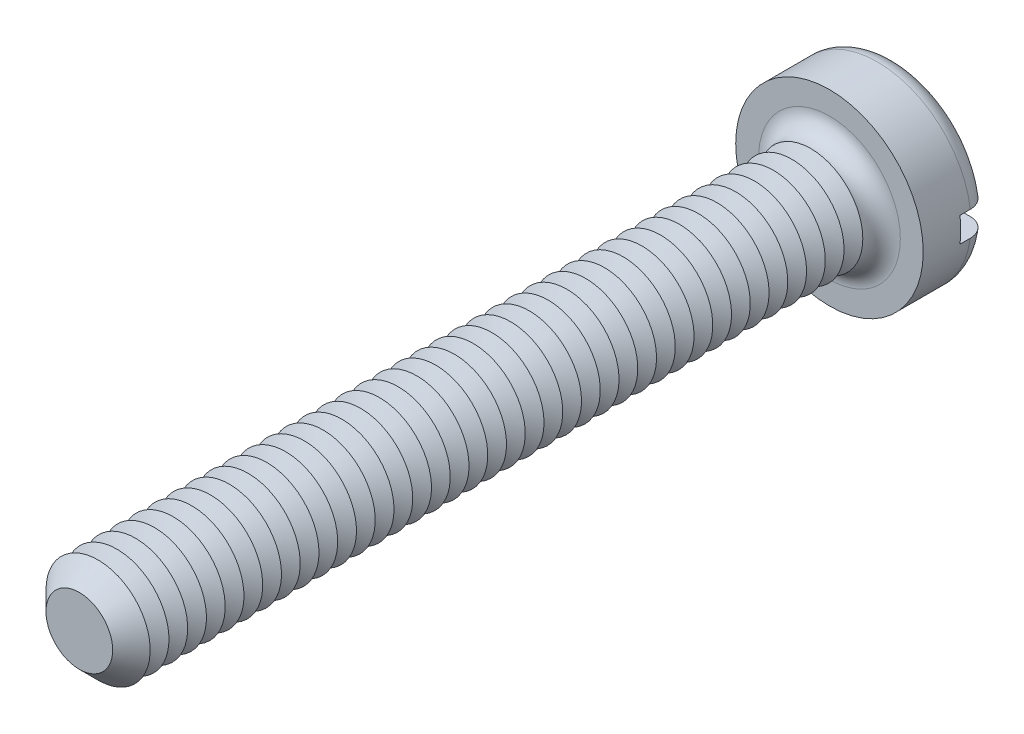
ISO-10303-21;
HEADER;
FILE_DESCRIPTION(('STEP AP214'),'2;1');
FILE_NAME('part.step','',(''),(''),'','','');
FILE_SCHEMA(('AUTOMOTIVE_DESIGN { 1 0 10303 214 1 1 1 1 }'));
ENDSEC;
DATA;
#1=APPLICATION_CONTEXT('core data for automotive mechanical design processes');
#2=APPLICATION_PROTOCOL_DEFINITION('international standard','automotive_design',2000,#1);
#3=PRODUCT_CONTEXT('',#1,'mechanical');
#4=PRODUCT('Part','Part','',(#3));
#5=PRODUCT_RELATED_PRODUCT_CATEGORY('part','',(#4));
#6=PRODUCT_DEFINITION_FORMATION('','',#4);
#7=PRODUCT_DEFINITION_CONTEXT('part definition',#1,'design');
#8=PRODUCT_DEFINITION('design','',#6,#7);
#9=PRODUCT_DEFINITION_SHAPE('','',#8);
#10=(LENGTH_UNIT() NAMED_UNIT(*) SI_UNIT(.MILLI.,.METRE.));
#11=(NAMED_UNIT(*) PLANE_ANGLE_UNIT() SI_UNIT($,.RADIAN.));
#12=(NAMED_UNIT(*) SI_UNIT($,.STERADIAN.) SOLID_ANGLE_UNIT());
#13=UNCERTAINTY_MEASURE_WITH_UNIT(LENGTH_MEASURE(1.E-05),#10,'distance_accuracy_value','');
#14=(GEOMETRIC_REPRESENTATION_CONTEXT(3) GLOBAL_UNCERTAINTY_ASSIGNED_CONTEXT((#13)) GLOBAL_UNIT_ASSIGNED_CONTEXT((#10,
#11,#12)) REPRESENTATION_CONTEXT('',''));
#15=CARTESIAN_POINT('',(0.,0.,0.));
#16=DIRECTION('',(0.,0.,1.));
#17=DIRECTION('',(1.,0.,0.));
#18=AXIS2_PLACEMENT_3D('',#15,#16,#17);
#19=CARTESIAN_POINT('',(0.,0.,-1.6));
#20=DIRECTION('',(0.,0.,1.));
#21=DIRECTION('',(1.,0.,0.));
#22=AXIS2_PLACEMENT_3D('',#19,#20,#21);
#23=PLANE('',#22);
#24=CARTESIAN_POINT('',(0.,0.,-1.6));
#25=DIRECTION('',(0.,0.,1.));
#26=DIRECTION('',(1.,0.,0.));
#27=AXIS2_PLACEMENT_3D('',#24,#25,#26);
#28=CIRCLE('',#27,1.8);
#29=CARTESIAN_POINT('',(-1.77482393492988,0.3,-1.6));
#30=VERTEX_POINT('',#29);
#31=CARTESIAN_POINT('',(1.77482393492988,0.3,-1.6));
#32=VERTEX_POINT('',#31);
#33=EDGE_CURVE('E116',#30,#32,#28,.F.);
#34=ORIENTED_EDGE('',*,*,#33,.T.);
#35=DIRECTION('',(1.,0.,0.));
#36=VECTOR('',#35,1.);
#37=CARTESIAN_POINT('',(-2.25,0.3,-1.6));
#38=LINE('',#37,#36);
#39=EDGE_CURVE('E111',#30,#32,#38,.T.);
#40=ORIENTED_EDGE('',*,*,#39,.F.);
#41=EDGE_LOOP('',(#34,#40));
#42=FACE_BOUND('',#41,.T.);
#43=ADVANCED_FACE('F39',(#42),#23,.F.);
#44=CARTESIAN_POINT('',(0.,0.,-1.15));
#45=DIRECTION('',(0.,0.,1.));
#46=DIRECTION('',(1.,0.,0.));
#47=AXIS2_PLACEMENT_3D('',#44,#45,#46);
#48=TOROIDAL_SURFACE('',#47,1.8,0.45);
#49=CARTESIAN_POINT('',(-2.09367249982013,0.3,-1.4713087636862));
#50=CARTESIAN_POINT('',(-2.07531034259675,0.3,-1.48912990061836));
#51=CARTESIAN_POINT('',(-2.05541605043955,0.3,-1.50540110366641));
#52=CARTESIAN_POINT('',(-2.01315405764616,0.3,-1.53437465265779));
#53=CARTESIAN_POINT('',(-1.99078310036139,0.3,-1.54707221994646));
#54=CARTESIAN_POINT('',(-1.94425163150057,0.3,-1.56853090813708));
#55=CARTESIAN_POINT('',(-1.92009286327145,0.3,-1.57729580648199));
#56=CARTESIAN_POINT('',(-1.8706617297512,0.3,-1.59068015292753));
#57=CARTESIAN_POINT('',(-1.84538964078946,0.3,-1.59530062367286));
#58=CARTESIAN_POINT('',(-1.7942134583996,0.3,-1.60031507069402));
#59=CARTESIAN_POINT('',(-1.76830582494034,0.3,-1.60067291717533));
#60=CARTESIAN_POINT('',(-1.71679040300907,0.3,-1.59707477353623));
#61=CARTESIAN_POINT('',(-1.69118264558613,0.3,-1.59311834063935));
#62=CARTESIAN_POINT('',(-1.64075792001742,0.3,-1.58095464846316));
#63=CARTESIAN_POINT('',(-1.61594989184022,0.3,-1.57271029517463));
#64=CARTESIAN_POINT('',(-1.56806655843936,0.3,-1.55217762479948));
#65=CARTESIAN_POINT('',(-1.54499130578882,0.3,-1.53988918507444));
#66=CARTESIAN_POINT('',(-1.50122413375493,0.3,-1.51158963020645));
#67=CARTESIAN_POINT('',(-1.48053389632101,0.3,-1.49557591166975));
#68=CARTESIAN_POINT('',(-1.44217532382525,0.3,-1.46026359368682));
#69=CARTESIAN_POINT('',(-1.42450683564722,0.3,-1.4409651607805));
#70=CARTESIAN_POINT('',(-1.39293961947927,0.3,-1.39986821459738));
#71=CARTESIAN_POINT('',(-1.37899788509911,0.3,-1.37810275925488));
#72=CARTESIAN_POINT('',(-1.35506190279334,0.3,-1.33249939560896));
#73=CARTESIAN_POINT('',(-1.34506709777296,0.3,-1.30866178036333));
#74=CARTESIAN_POINT('',(-1.3295415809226,0.3,-1.26015137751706));
#75=CARTESIAN_POINT('',(-1.32391771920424,0.3,-1.23550839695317));
#76=CARTESIAN_POINT('',(-1.31696995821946,0.3,-1.18562442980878));
#77=CARTESIAN_POINT('',(-1.31564552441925,0.3,-1.16038351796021));
#78=CARTESIAN_POINT('',(-1.31732714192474,0.3,-1.11049178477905));
#79=CARTESIAN_POINT('',(-1.32025766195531,0.3,-1.08583837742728));
#80=CARTESIAN_POINT('',(-1.3302124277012,0.3,-1.03737369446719));
#81=CARTESIAN_POINT('',(-1.33723664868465,0.3,-1.01356241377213));
#82=CARTESIAN_POINT('',(-1.35515820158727,0.3,-0.967413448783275));
#83=CARTESIAN_POINT('',(-1.36606032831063,0.3,-0.945077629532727));
#84=CARTESIAN_POINT('',(-1.39139351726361,0.3,-0.902507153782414));
#85=CARTESIAN_POINT('',(-1.40582489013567,0.3,-0.882272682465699));
#86=CARTESIAN_POINT('',(-1.43808691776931,0.3,-0.844072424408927));
#87=CARTESIAN_POINT('',(-1.4559757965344,0.3,-0.826155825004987));
#88=CARTESIAN_POINT('',(-1.49445205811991,0.3,-0.793502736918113));
#89=CARTESIAN_POINT('',(-1.51503974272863,0.3,-0.778766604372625));
#90=CARTESIAN_POINT('',(-1.55880475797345,0.3,-0.752571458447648));
#91=CARTESIAN_POINT('',(-1.58202794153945,0.3,-0.741189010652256));
#92=CARTESIAN_POINT('',(-1.63004083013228,0.3,-0.722432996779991));
#93=CARTESIAN_POINT('',(-1.65483064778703,0.3,-0.715059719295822));
#94=CARTESIAN_POINT('',(-1.70558060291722,0.3,-0.704463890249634));
#95=CARTESIAN_POINT('',(-1.73155090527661,0.3,-0.701289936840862));
#96=CARTESIAN_POINT('',(-1.78365633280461,0.3,-0.699350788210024));
#97=CARTESIAN_POINT('',(-1.80979145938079,0.3,-0.700585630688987));
#98=CARTESIAN_POINT('',(-1.86145503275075,0.3,-0.70744393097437));
#99=CARTESIAN_POINT('',(-1.88698403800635,0.3,-0.713063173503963));
#100=CARTESIAN_POINT('',(-1.93672112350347,0.3,-0.728546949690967));
#101=CARTESIAN_POINT('',(-1.96092925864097,0.3,-0.738411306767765));
#102=CARTESIAN_POINT('',(-2.00710191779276,0.3,-0.762015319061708));
#103=CARTESIAN_POINT('',(-2.02908465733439,0.3,-0.775719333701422));
#104=CARTESIAN_POINT('',(-2.0704025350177,0.3,-0.806663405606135));
#105=CARTESIAN_POINT('',(-2.08973782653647,0.3,-0.823903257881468));
#106=CARTESIAN_POINT('',(-2.12497879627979,0.3,-0.861218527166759));
#107=CARTESIAN_POINT('',(-2.1409209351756,0.3,-0.881259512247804));
#108=CARTESIAN_POINT('',(-2.16917502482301,0.3,-0.92375535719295));
#109=CARTESIAN_POINT('',(-2.18148717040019,0.3,-0.946210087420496));
#110=CARTESIAN_POINT('',(-2.20201023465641,0.3,-0.99266079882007));
#111=CARTESIAN_POINT('',(-2.21025973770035,0.3,-1.01663973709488));
#112=CARTESIAN_POINT('',(-2.22258852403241,0.3,-1.06564563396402));
#113=CARTESIAN_POINT('',(-2.22666813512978,0.3,-1.0906725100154));
#114=CARTESIAN_POINT('',(-2.23052418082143,0.3,-1.14090288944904));
#115=CARTESIAN_POINT('',(-2.23032644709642,0.3,-1.16610441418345));
#116=CARTESIAN_POINT('',(-2.22569614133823,0.3,-1.21612212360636));
#117=CARTESIAN_POINT('',(-2.2212625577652,0.3,-1.24093821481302));
#118=CARTESIAN_POINT('',(-2.20829785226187,0.3,-1.2894516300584));
#119=CARTESIAN_POINT('',(-2.19976997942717,0.3,-1.31314982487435));
#120=CARTESIAN_POINT('',(-2.17887390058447,0.3,-1.35876313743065));
#121=CARTESIAN_POINT('',(-2.1665103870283,0.3,-1.3806803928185));
#122=CARTESIAN_POINT('',(-2.14384463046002,0.3,-1.4140108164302));
#123=CARTESIAN_POINT('',(-2.13462949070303,0.3,-1.42617780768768));
#124=CARTESIAN_POINT('',(-2.1150151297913,0.3,-1.44951629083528));
#125=CARTESIAN_POINT('',(-2.10461591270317,0.3,-1.46068778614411));
#126=CARTESIAN_POINT('',(-2.09367249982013,0.3,-1.4713087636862));
#127=B_SPLINE_CURVE_WITH_KNOTS('',3,(#49,#50,#51,#52,#53,#54,#55,#56,#57,#58,#59,#60,#61,#62,
#63,#64,#65,#66,#67,#68,#69,#70,#71,#72,#73,#74,#75,#76,#77,#78,#79,#80,#81,#82,#83,#84,#85,#86,
#87,#88,#89,#90,#91,#92,#93,#94,#95,#96,#97,#98,#99,#100,#101,#102,#103,#104,#105,#106,#107,
#108,#109,#110,#111,#112,#113,#114,#115,#116,#117,#118,#119,#120,#121,#122,#123,#124,#125,#126),
.UNSPECIFIED.,.T.,.F.,(4,2,2,2,2,2,2,2,2,2,2,2,2,2,2,2,2,2,2,2,2,2,2,2,2,2,2,2,2,2,2,2,2,2,2,2,
2,2,4),(0.,0.0767085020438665,0.153519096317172,0.230255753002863,0.306973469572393,
0.384340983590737,0.461716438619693,0.539772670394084,0.617831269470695,0.695944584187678,
0.774053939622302,0.851218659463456,0.928372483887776,1.00383319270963,1.07928451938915,
1.15341274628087,1.22754052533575,1.30176027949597,1.37598656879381,1.45159320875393,
1.52720831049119,1.6044355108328,1.68166826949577,1.75978723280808,1.8379068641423,
1.91595148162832,1.99399285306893,2.07133254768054,2.14866775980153,2.22512456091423,
2.30157725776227,2.3772891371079,2.45299506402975,2.52824391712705,2.60351074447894,
2.67871794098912,2.75383349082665,2.79955010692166,2.84526656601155),.UNSPECIFIED.);
#128=CARTESIAN_POINT('',(-2.22991031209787,0.3,-1.14999999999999));
#129=VERTEX_POINT('',#128);
#130=EDGE_CURVE('E482',#129,#30,#127,.T.);
#131=ORIENTED_EDGE('',*,*,#130,.F.);
#132=CARTESIAN_POINT('',(0.,0.,-1.15));
#133=DIRECTION('',(0.,0.,1.));
#134=DIRECTION('',(1.,0.,0.));
#135=AXIS2_PLACEMENT_3D('',#132,#133,#134);
#136=CIRCLE('',#135,2.25);
#137=CARTESIAN_POINT('',(2.22991031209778,0.3,-1.15));
#138=VERTEX_POINT('',#137);
#139=EDGE_CURVE('E124',#138,#129,#136,.T.);
#140=ORIENTED_EDGE('',*,*,#139,.F.);
#141=CARTESIAN_POINT('',(1.39325818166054,0.3,-1.39903402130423));
#142=CARTESIAN_POINT('',(1.40771723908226,0.3,-1.42030595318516));
#143=CARTESIAN_POINT('',(1.4240122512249,0.3,-1.4403555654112));
#144=CARTESIAN_POINT('',(1.45976320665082,0.3,-1.4774406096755));
#145=CARTESIAN_POINT('',(1.47922380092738,0.3,-1.49447152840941));
#146=CARTESIAN_POINT('',(1.5206923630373,0.3,-1.52502510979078));
#147=CARTESIAN_POINT('',(1.54269721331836,0.3,-1.53855200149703));
#148=CARTESIAN_POINT('',(1.58863815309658,0.3,-1.56176272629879));
#149=CARTESIAN_POINT('',(1.61257369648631,0.3,-1.57144764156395));
#150=CARTESIAN_POINT('',(1.66199169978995,0.3,-1.58680804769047));
#151=CARTESIAN_POINT('',(1.68748839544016,0.3,-1.59243778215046));
#152=CARTESIAN_POINT('',(1.73906656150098,0.3,-1.59934902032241));
#153=CARTESIAN_POINT('',(1.76514807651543,0.3,-1.60063019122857));
#154=CARTESIAN_POINT('',(1.81721740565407,0.3,-1.59879130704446));
#155=CARTESIAN_POINT('',(1.84320486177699,0.3,-1.59566102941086));
#156=CARTESIAN_POINT('',(1.89427635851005,0.3,-1.58504931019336));
#157=CARTESIAN_POINT('',(1.91936042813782,0.3,-1.57756800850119));
#158=CARTESIAN_POINT('',(1.9677137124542,0.3,-1.55851722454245));
#159=CARTESIAN_POINT('',(1.99099484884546,0.3,-1.5469780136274));
#160=CARTESIAN_POINT('',(2.03525897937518,0.3,-1.52011224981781));
#161=CARTESIAN_POINT('',(2.05624211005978,0.3,-1.50478592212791));
#162=CARTESIAN_POINT('',(2.09506403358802,0.3,-1.47096472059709));
#163=CARTESIAN_POINT('',(2.11293536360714,0.3,-1.45250719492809));
#164=CARTESIAN_POINT('',(2.14528563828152,0.3,-1.41282609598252));
#165=CARTESIAN_POINT('',(2.15976477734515,0.3,-1.39160268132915));
#166=CARTESIAN_POINT('',(2.18476262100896,0.3,-1.34723254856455));
#167=CARTESIAN_POINT('',(2.19532119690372,0.3,-1.32410828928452));
#168=CARTESIAN_POINT('',(2.21237438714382,0.3,-1.27640693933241));
#169=CARTESIAN_POINT('',(2.21886918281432,0.3,-1.25182991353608));
#170=CARTESIAN_POINT('',(2.2275687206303,0.3,-1.20210937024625));
#171=CARTESIAN_POINT('',(2.22980376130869,0.3,-1.17697115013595));
#172=CARTESIAN_POINT('',(2.23000940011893,0.3,-1.12667754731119));
#173=CARTESIAN_POINT('',(2.22798009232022,0.3,-1.10152216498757));
#174=CARTESIAN_POINT('',(2.21972856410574,0.3,-1.05197773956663));
#175=CARTESIAN_POINT('',(2.21351744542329,0.3,-1.02758684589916));
#176=CARTESIAN_POINT('',(2.19709696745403,0.3,-0.980190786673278));
#177=CARTESIAN_POINT('',(2.18688760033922,0.3,-0.957185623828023));
#178=CARTESIAN_POINT('',(2.1627435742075,0.3,-0.913157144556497));
#179=CARTESIAN_POINT('',(2.14880093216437,0.3,-0.892138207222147));
#180=CARTESIAN_POINT('',(2.11760640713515,0.3,-0.852719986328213));
#181=CARTESIAN_POINT('',(2.10035443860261,0.3,-0.834320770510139));
#182=CARTESIAN_POINT('',(2.06291254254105,0.3,-0.80052923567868));
#183=CARTESIAN_POINT('',(2.04270386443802,0.3,-0.785157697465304));
#184=CARTESIAN_POINT('',(2.0000139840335,0.3,-0.757986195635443));
#185=CARTESIAN_POINT('',(1.97753267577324,0.3,-0.746186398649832));
#186=CARTESIAN_POINT('',(1.93069507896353,0.3,-0.726364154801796));
#187=CARTESIAN_POINT('',(1.90632219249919,0.3,-0.718380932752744));
#188=CARTESIAN_POINT('',(1.85658993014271,0.3,-0.706569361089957));
#189=CARTESIAN_POINT('',(1.83123049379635,0.3,-0.702741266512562));
#190=CARTESIAN_POINT('',(1.77994107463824,0.3,-0.699306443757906));
#191=CARTESIAN_POINT('',(1.75400788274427,0.3,-0.69974759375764));
#192=CARTESIAN_POINT('',(1.70257608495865,0.3,-0.704939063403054));
#193=CARTESIAN_POINT('',(1.67707750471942,0.3,-0.709689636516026));
#194=CARTESIAN_POINT('',(1.62701662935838,0.3,-0.723419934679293));
#195=CARTESIAN_POINT('',(1.60246387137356,0.3,-0.732434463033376));
#196=CARTESIAN_POINT('',(1.55521886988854,0.3,-0.754458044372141));
#197=CARTESIAN_POINT('',(1.53252668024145,0.3,-0.76746721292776));
#198=CARTESIAN_POINT('',(1.48966925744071,0.3,-0.797124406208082));
#199=CARTESIAN_POINT('',(1.46950315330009,0.3,-0.813771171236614));
#200=CARTESIAN_POINT('',(1.43229728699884,0.3,-0.850255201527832));
#201=CARTESIAN_POINT('',(1.41525734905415,0.3,-0.870092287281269));
#202=CARTESIAN_POINT('',(1.3850470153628,0.3,-0.912123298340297));
#203=CARTESIAN_POINT('',(1.37182821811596,0.3,-0.934282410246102));
#204=CARTESIAN_POINT('',(1.34939737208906,0.3,-0.980542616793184));
#205=CARTESIAN_POINT('',(1.34018456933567,0.3,-1.00464334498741));
#206=CARTESIAN_POINT('',(1.32624172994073,0.3,-1.05352472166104));
#207=CARTESIAN_POINT('',(1.32141599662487,0.3,-1.07827808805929));
#208=CARTESIAN_POINT('',(1.31606478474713,0.3,-1.12825155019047));
#209=CARTESIAN_POINT('',(1.31553992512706,0.3,-1.15347171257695));
#210=CARTESIAN_POINT('',(1.31878307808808,0.3,-1.20323022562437));
#211=CARTESIAN_POINT('',(1.32248353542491,0.3,-1.22777305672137));
#212=CARTESIAN_POINT('',(1.33394086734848,0.3,-1.27586981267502));
#213=CARTESIAN_POINT('',(1.34169274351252,0.3,-1.2994249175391));
#214=CARTESIAN_POINT('',(1.35704250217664,0.3,-1.33561898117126));
#215=CARTESIAN_POINT('',(1.36341395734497,0.3,-1.34879219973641));
#216=CARTESIAN_POINT('',(1.37741190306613,0.3,-1.37445328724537));
#217=CARTESIAN_POINT('',(1.38503837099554,0.3,-1.38694116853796));
#218=CARTESIAN_POINT('',(1.39325818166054,0.3,-1.39903402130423));
#219=B_SPLINE_CURVE_WITH_KNOTS('',3,(#141,#142,#143,#144,#145,#146,#147,#148,#149,#150,#151,
#152,#153,#154,#155,#156,#157,#158,#159,#160,#161,#162,#163,#164,#165,#166,#167,#168,#169,#170,
#171,#172,#173,#174,#175,#176,#177,#178,#179,#180,#181,#182,#183,#184,#185,#186,#187,#188,#189,
#190,#191,#192,#193,#194,#195,#196,#197,#198,#199,#200,#201,#202,#203,#204,#205,#206,#207,#208,
#209,#210,#211,#212,#213,#214,#215,#216,#217,#218),.UNSPECIFIED.,.T.,.F.,(4,2,2,2,2,2,2,2,2,2,2,
2,2,2,2,2,2,2,2,2,2,2,2,2,2,2,2,2,2,2,2,2,2,2,2,2,2,2,4),(0.,0.0771077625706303,
0.154329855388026,0.231458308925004,0.308565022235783,0.386528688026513,0.464498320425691,
0.542648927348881,0.620797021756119,0.698374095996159,0.77594655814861,0.852651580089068,
0.929352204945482,1.00524992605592,1.08114426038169,1.15649673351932,1.2318475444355,
1.30699910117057,1.38215080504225,1.45746451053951,1.53278016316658,1.60859599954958,
1.68441537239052,1.76099806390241,1.83758545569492,1.91503273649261,1.99248457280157,
2.07057979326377,2.14867727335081,2.22674775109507,2.30481383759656,2.38184276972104,
2.45885719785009,2.53414829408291,2.6094502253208,2.68356487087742,2.75758829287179,
2.80142397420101,2.84525886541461),.UNSPECIFIED.);
#220=EDGE_CURVE('E484',#32,#138,#219,.T.);
#221=ORIENTED_EDGE('',*,*,#220,.F.);
#222=ORIENTED_EDGE('',*,*,#33,.F.);
#223=EDGE_LOOP('',(#131,#140,#221,#222));
#224=FACE_BOUND('',#223,.T.);
#225=ADVANCED_FACE('F466',(#224),#48,.T.);
#226=CARTESIAN_POINT('',(0.,0.,-1.6));
#227=DIRECTION('',(0.,0.,1.));
#228=DIRECTION('',(1.,0.,0.));
#229=AXIS2_PLACEMENT_3D('',#226,#227,#228);
#230=CYLINDRICAL_SURFACE('',#229,2.25);
#231=DIRECTION('',(0.,0.,1.));
#232=VECTOR('',#231,1.);
#233=CARTESIAN_POINT('',(2.22991031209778,0.3,-1.6));
#234=LINE('',#233,#232);
#235=CARTESIAN_POINT('',(2.22991031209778,0.3,-0.9));
#236=VERTEX_POINT('',#235);
#237=EDGE_CURVE('E499',#138,#236,#234,.T.);
#238=ORIENTED_EDGE('',*,*,#237,.F.);
#239=ORIENTED_EDGE('',*,*,#139,.T.);
#240=DIRECTION('',(0.,0.,1.));
#241=VECTOR('',#240,1.);
#242=CARTESIAN_POINT('',(-2.22991031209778,0.3,-1.6));
#243=LINE('',#242,#241);
#244=CARTESIAN_POINT('',(-2.22991031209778,0.3,-0.9));
#245=VERTEX_POINT('',#244);
#246=EDGE_CURVE('E63',#245,#129,#243,.F.);
#247=ORIENTED_EDGE('',*,*,#246,.F.);
#248=CARTESIAN_POINT('',(0.,0.,-0.9));
#249=DIRECTION('',(0.,0.,-1.));
#250=DIRECTION('',(-1.,0.,0.));
#251=AXIS2_PLACEMENT_3D('',#248,#249,#250);
#252=CIRCLE('',#251,2.25);
#253=CARTESIAN_POINT('',(-2.22991031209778,-0.3,-0.9));
#254=VERTEX_POINT('',#253);
#255=EDGE_CURVE('E43',#245,#254,#252,.F.);
#256=ORIENTED_EDGE('',*,*,#255,.T.);
#257=DIRECTION('',(0.,0.,1.));
#258=VECTOR('',#257,1.);
#259=CARTESIAN_POINT('',(-2.22991031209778,-0.3,-1.6));
#260=LINE('',#259,#258);
#261=CARTESIAN_POINT('',(-2.22991031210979,-0.3,-1.15000000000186));
#262=VERTEX_POINT('',#261);
#263=EDGE_CURVE('E496',#262,#254,#260,.T.);
#264=ORIENTED_EDGE('',*,*,#263,.F.);
#265=CARTESIAN_POINT('',(2.22991031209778,-0.3,-1.15));
#266=VERTEX_POINT('',#265);
#267=EDGE_CURVE('E126',#262,#266,#136,.T.);
#268=ORIENTED_EDGE('',*,*,#267,.T.);
#269=DIRECTION('',(0.,0.,1.));
#270=VECTOR('',#269,1.);
#271=CARTESIAN_POINT('',(2.22991031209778,-0.3,-1.6));
#272=LINE('',#271,#270);
#273=CARTESIAN_POINT('',(2.22991031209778,-0.3,-0.9));
#274=VERTEX_POINT('',#273);
#275=EDGE_CURVE('E55',#274,#266,#272,.F.);
#276=ORIENTED_EDGE('',*,*,#275,.F.);
#277=EDGE_CURVE('E11',#274,#236,#252,.F.);
#278=ORIENTED_EDGE('',*,*,#277,.T.);
#279=EDGE_LOOP('',(#238,#239,#247,#256,#264,#268,#276,#278));
#280=FACE_BOUND('',#279,.T.);
#281=CARTESIAN_POINT('',(0.,0.,0.));
#282=DIRECTION('',(0.,0.,1.));
#283=DIRECTION('',(1.,0.,0.));
#284=AXIS2_PLACEMENT_3D('',#281,#282,#283);
#285=CIRCLE('',#284,2.25);
#286=CARTESIAN_POINT('',(2.25,0.,0.));
#287=VERTEX_POINT('',#286);
#288=EDGE_CURVE('E502',#287,#287,#285,.T.);
#289=ORIENTED_EDGE('',*,*,#288,.F.);
#290=EDGE_LOOP('',(#289));
#291=FACE_BOUND('',#290,.T.);
#292=ADVANCED_FACE('F462',(#280,#291),#230,.T.);
#293=CARTESIAN_POINT('',(1.77482393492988,-0.3,-1.6));
#294=VERTEX_POINT('',#293);
#295=CARTESIAN_POINT('',(-1.77482393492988,-0.3,-1.6));
#296=VERTEX_POINT('',#295);
#297=EDGE_CURVE('E109',#294,#296,#28,.F.);
#298=ORIENTED_EDGE('',*,*,#297,.T.);
#299=DIRECTION('',(-1.,0.,0.));
#300=VECTOR('',#299,1.);
#301=CARTESIAN_POINT('',(-2.25,-0.3,-1.6));
#302=LINE('',#301,#300);
#303=EDGE_CURVE('E96',#294,#296,#302,.T.);
#304=ORIENTED_EDGE('',*,*,#303,.F.);
#305=EDGE_LOOP('',(#298,#304));
#306=FACE_BOUND('',#305,.T.);
#307=ADVANCED_FACE('F108',(#306),#23,.F.);
#308=CARTESIAN_POINT('',(0.,0.,0.));
#309=DIRECTION('',(0.,0.,1.));
#310=DIRECTION('',(1.,0.,0.));
#311=AXIS2_PLACEMENT_3D('',#308,#309,#310);
#312=PLANE('',#311);
#313=CARTESIAN_POINT('',(0.,0.,0.));
#314=DIRECTION('',(0.,0.,1.));
#315=DIRECTION('',(1.,0.,0.));
#316=AXIS2_PLACEMENT_3D('',#313,#314,#315);
#317=CIRCLE('',#316,1.7);
#318=CARTESIAN_POINT('',(1.7,0.,0.));
#319=VERTEX_POINT('',#318);
#320=EDGE_CURVE('E115',#319,#319,#317,.F.);
#321=ORIENTED_EDGE('',*,*,#320,.T.);
#322=EDGE_LOOP('',(#321));
#323=FACE_BOUND('',#322,.T.);
#324=ORIENTED_EDGE('',*,*,#288,.T.);
#325=EDGE_LOOP('',(#324));
#326=FACE_BOUND('',#325,.T.);
#327=ADVANCED_FACE('F461',(#323,#326),#312,.T.);
#328=CARTESIAN_POINT('',(-2.09367249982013,-0.3,-1.4713087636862));
#329=CARTESIAN_POINT('',(-2.11176539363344,-0.3,-1.45374579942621));
#330=CARTESIAN_POINT('',(-2.1283968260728,-0.3,-1.43465254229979));
#331=CARTESIAN_POINT('',(-2.15823692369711,-0.3,-1.39393307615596));
#332=CARTESIAN_POINT('',(-2.17144184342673,-0.3,-1.37230413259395));
#333=CARTESIAN_POINT('',(-2.19402281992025,-0.3,-1.32713362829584));
#334=CARTESIAN_POINT('',(-2.20339951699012,-0.3,-1.30359238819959));
#335=CARTESIAN_POINT('',(-2.21804409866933,-0.3,-1.25527081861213));
#336=CARTESIAN_POINT('',(-2.22331295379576,-0.3,-1.23049078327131));
#337=CARTESIAN_POINT('',(-2.22957448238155,-0.3,-1.18050893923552));
#338=CARTESIAN_POINT('',(-2.23058617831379,-0.3,-1.15530951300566));
#339=CARTESIAN_POINT('',(-2.22835535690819,-0.3,-1.10509920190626));
#340=CARTESIAN_POINT('',(-2.22511277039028,-0.3,-1.08008832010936));
#341=CARTESIAN_POINT('',(-2.21448018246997,-0.3,-1.03101646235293));
#342=CARTESIAN_POINT('',(-2.20709836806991,-0.3,-1.00695371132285));
#343=CARTESIAN_POINT('',(-2.18841075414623,-0.3,-0.960404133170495));
#344=CARTESIAN_POINT('',(-2.17710493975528,-0.3,-0.937917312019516));
#345=CARTESIAN_POINT('',(-2.15086234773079,-0.3,-0.895085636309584));
#346=CARTESIAN_POINT('',(-2.13591537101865,-0.3,-0.874747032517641));
#347=CARTESIAN_POINT('',(-2.1028415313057,-0.3,-0.836845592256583));
#348=CARTESIAN_POINT('',(-2.08471458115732,-0.3,-0.819282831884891));
#349=CARTESIAN_POINT('',(-2.0456590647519,-0.3,-0.78729174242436));
#350=CARTESIAN_POINT('',(-2.0247112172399,-0.3,-0.772886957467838));
#351=CARTESIAN_POINT('',(-1.98071452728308,-0.3,-0.747756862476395));
#352=CARTESIAN_POINT('',(-1.95766557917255,-0.3,-0.737031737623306));
#353=CARTESIAN_POINT('',(-1.90986554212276,-0.3,-0.71944451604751));
#354=CARTESIAN_POINT('',(-1.88509923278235,-0.3,-0.712623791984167));
#355=CARTESIAN_POINT('',(-1.83477837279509,-0.3,-0.703186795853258));
#356=CARTESIAN_POINT('',(-1.80922377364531,-0.3,-0.700570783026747));
#357=CARTESIAN_POINT('',(-1.75774893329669,-0.3,-0.699591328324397));
#358=CARTESIAN_POINT('',(-1.73182778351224,-0.3,-0.701275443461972));
#359=CARTESIAN_POINT('',(-1.68062744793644,-0.3,-0.708937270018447));
#360=CARTESIAN_POINT('',(-1.65534829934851,-0.3,-0.714915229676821));
#361=CARTESIAN_POINT('',(-1.6059539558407,-0.3,-0.731056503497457));
#362=CARTESIAN_POINT('',(-1.58184881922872,-0.3,-0.741250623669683));
#363=CARTESIAN_POINT('',(-1.53569497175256,-0.3,-0.765548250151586));
#364=CARTESIAN_POINT('',(-1.51364629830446,-0.3,-0.779651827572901));
#365=CARTESIAN_POINT('',(-1.47229470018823,-0.3,-0.811355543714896));
#366=CARTESIAN_POINT('',(-1.45298625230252,-0.3,-0.828948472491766));
#367=CARTESIAN_POINT('',(-1.41765142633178,-0.3,-0.867170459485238));
#368=CARTESIAN_POINT('',(-1.40162480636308,-0.3,-0.887799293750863));
#369=CARTESIAN_POINT('',(-1.37358365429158,-0.3,-0.93118317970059));
#370=CARTESIAN_POINT('',(-1.3615121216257,-0.3,-0.953901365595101));
#371=CARTESIAN_POINT('',(-1.34145576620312,-0.3,-1.00107529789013));
#372=CARTESIAN_POINT('',(-1.33347032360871,-0.3,-1.02553078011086));
#373=CARTESIAN_POINT('',(-1.32199536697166,-0.3,-1.07489401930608));
#374=CARTESIAN_POINT('',(-1.31840873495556,-0.3,-1.09977921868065));
#375=CARTESIAN_POINT('',(-1.31553052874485,-0.3,-1.1497957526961));
#376=CARTESIAN_POINT('',(-1.31623852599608,-0.3,-1.17492706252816));
#377=CARTESIAN_POINT('',(-1.32188368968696,-0.3,-1.22435119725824));
#378=CARTESIAN_POINT('',(-1.32676151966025,-0.3,-1.24865083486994));
#379=CARTESIAN_POINT('',(-1.34050334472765,-0.3,-1.29609421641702));
#380=CARTESIAN_POINT('',(-1.34936742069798,-0.3,-1.31923793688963));
#381=CARTESIAN_POINT('',(-1.37086295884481,-0.3,-1.36387796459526));
#382=CARTESIAN_POINT('',(-1.38351729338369,-0.3,-1.38536324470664));
#383=CARTESIAN_POINT('',(-1.41218367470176,-0.3,-1.42596199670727));
#384=CARTESIAN_POINT('',(-1.42819606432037,-0.3,-1.44507522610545));
#385=CARTESIAN_POINT('',(-1.46347664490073,-0.3,-1.48081087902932));
#386=CARTESIAN_POINT('',(-1.48280543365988,-0.3,-1.49737347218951));
#387=CARTESIAN_POINT('',(-1.5239232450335,-0.3,-1.52709508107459));
#388=CARTESIAN_POINT('',(-1.54571253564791,-0.3,-1.54025372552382));
#389=CARTESIAN_POINT('',(-1.59160097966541,-0.3,-1.56305446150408));
#390=CARTESIAN_POINT('',(-1.61573734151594,-0.3,-1.57262172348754));
#391=CARTESIAN_POINT('',(-1.66526504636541,-0.3,-1.58760700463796));
#392=CARTESIAN_POINT('',(-1.69065641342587,-0.3,-1.59302494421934));
#393=CARTESIAN_POINT('',(-1.74220154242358,-0.3,-1.59958446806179));
#394=CARTESIAN_POINT('',(-1.7683598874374,-0.3,-1.60069012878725));
#395=CARTESIAN_POINT('',(-1.82049681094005,-0.3,-1.59847888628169));
#396=CARTESIAN_POINT('',(-1.8464753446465,-0.3,-1.59516091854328));
#397=CARTESIAN_POINT('',(-1.89742078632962,-0.3,-1.58419269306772));
#398=CARTESIAN_POINT('',(-1.92239041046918,-0.3,-1.57655503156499));
#399=CARTESIAN_POINT('',(-1.97064988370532,-0.3,-1.55715679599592));
#400=CARTESIAN_POINT('',(-1.99394179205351,-0.3,-1.54540138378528));
#401=CARTESIAN_POINT('',(-2.03003215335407,-0.3,-1.52312594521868));
#402=CARTESIAN_POINT('',(-2.04354254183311,-0.3,-1.51373809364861));
#403=CARTESIAN_POINT('',(-2.06946640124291,-0.3,-1.49355310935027));
#404=CARTESIAN_POINT('',(-2.08187987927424,-0.3,-1.48275598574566));
#405=CARTESIAN_POINT('',(-2.09367249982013,-0.3,-1.4713087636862));
#406=B_SPLINE_CURVE_WITH_KNOTS('',3,(#328,#329,#330,#331,#332,#333,#334,#335,#336,#337,#338,
#339,#340,#341,#342,#343,#344,#345,#346,#347,#348,#349,#350,#351,#352,#353,#354,#355,#356,#357,
#358,#359,#360,#361,#362,#363,#364,#365,#366,#367,#368,#369,#370,#371,#372,#373,#374,#375,#376,
#377,#378,#379,#380,#381,#382,#383,#384,#385,#386,#387,#388,#389,#390,#391,#392,#393,#394,#395,
#396,#397,#398,#399,#400,#401,#402,#403,#404,#405),.UNSPECIFIED.,.T.,.F.,(4,2,2,2,2,2,2,2,2,2,2,
2,2,2,2,2,2,2,2,2,2,2,2,2,2,2,2,2,2,2,2,2,2,2,2,2,2,2,4),(0.,0.0755864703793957,
0.151255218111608,0.226911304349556,0.302549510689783,0.377849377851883,0.453150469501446,
0.528303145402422,0.603456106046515,0.67882204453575,0.754190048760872,0.83010216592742,
0.906018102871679,0.982724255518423,1.05943513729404,1.13699806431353,1.21456547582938,
1.29270994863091,1.37085584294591,1.44884191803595,1.52682224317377,1.60362346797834,
1.68041303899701,1.75547480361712,1.83052907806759,1.90453278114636,1.97853798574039,
2.05299909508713,2.12746781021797,2.20347986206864,2.27950020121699,2.3570265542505,
2.43455439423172,2.5127267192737,2.59091785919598,2.66888216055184,2.74674907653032,
2.79601528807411,2.84528118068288),.UNSPECIFIED.);
#407=EDGE_CURVE('E103',#296,#262,#406,.T.);
#408=ORIENTED_EDGE('',*,*,#407,.F.);
#409=ORIENTED_EDGE('',*,*,#297,.F.);
#410=CARTESIAN_POINT('',(1.39325818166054,-0.3,-1.39903402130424));
#411=CARTESIAN_POINT('',(1.37924349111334,-0.3,-1.37841200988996));
#412=CARTESIAN_POINT('',(1.36693374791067,-0.3,-1.35661225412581));
#413=CARTESIAN_POINT('',(1.34612289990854,-0.3,-1.31124547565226));
#414=CARTESIAN_POINT('',(1.33762533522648,-0.3,-1.28767683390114));
#415=CARTESIAN_POINT('',(1.32472877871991,-0.3,-1.23943261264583));
#416=CARTESIAN_POINT('',(1.3203309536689,-0.3,-1.21475672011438));
#417=CARTESIAN_POINT('',(1.31579198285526,-0.3,-1.16502199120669));
#418=CARTESIAN_POINT('',(1.31564980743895,-0.3,-1.13996324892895));
#419=CARTESIAN_POINT('',(1.31960322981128,-0.3,-1.09044336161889));
#420=CARTESIAN_POINT('',(1.32365524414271,-0.3,-1.06597872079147));
#421=CARTESIAN_POINT('',(1.33579339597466,-0.3,-1.01807218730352));
#422=CARTESIAN_POINT('',(1.34387971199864,-0.3,-0.994630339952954));
#423=CARTESIAN_POINT('',(1.36386460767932,-0.3,-0.949319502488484));
#424=CARTESIAN_POINT('',(1.37577869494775,-0.3,-0.92745736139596));
#425=CARTESIAN_POINT('',(1.40303929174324,-0.3,-0.885990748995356));
#426=CARTESIAN_POINT('',(1.41838612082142,-0.3,-0.866386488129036));
#427=CARTESIAN_POINT('',(1.45239955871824,-0.3,-0.829572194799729));
#428=CARTESIAN_POINT('',(1.47112624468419,-0.3,-0.812417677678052));
#429=CARTESIAN_POINT('',(1.51114353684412,-0.3,-0.78141873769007));
#430=CARTESIAN_POINT('',(1.53243442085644,-0.3,-0.767574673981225));
#431=CARTESIAN_POINT('',(1.57744959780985,-0.3,-0.743302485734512));
#432=CARTESIAN_POINT('',(1.6012148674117,-0.3,-0.732950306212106));
#433=CARTESIAN_POINT('',(1.65013556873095,-0.3,-0.71633816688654));
#434=CARTESIAN_POINT('',(1.67529109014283,-0.3,-0.710078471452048));
#435=CARTESIAN_POINT('',(1.72654223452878,-0.3,-0.701786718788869));
#436=CARTESIAN_POINT('',(1.75264462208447,-0.3,-0.699796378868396));
#437=CARTESIAN_POINT('',(1.80481283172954,-0.3,-0.700236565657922));
#438=CARTESIAN_POINT('',(1.83087865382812,-0.3,-0.702667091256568));
#439=CARTESIAN_POINT('',(1.88216421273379,-0.3,-0.71188843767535));
#440=CARTESIAN_POINT('',(1.90738581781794,-0.3,-0.718668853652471));
#441=CARTESIAN_POINT('',(1.95631449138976,-0.3,-0.736408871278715));
#442=CARTESIAN_POINT('',(1.98002162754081,-0.3,-0.747368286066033));
#443=CARTESIAN_POINT('',(2.02500221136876,-0.3,-0.773046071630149));
#444=CARTESIAN_POINT('',(2.04629687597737,-0.3,-0.78772726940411));
#445=CARTESIAN_POINT('',(2.08608258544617,-0.3,-0.820494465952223));
#446=CARTESIAN_POINT('',(2.10457379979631,-0.3,-0.838580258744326));
#447=CARTESIAN_POINT('',(2.1380062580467,-0.3,-0.877422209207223));
#448=CARTESIAN_POINT('',(2.15298532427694,-0.3,-0.898145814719));
#449=CARTESIAN_POINT('',(2.17921311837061,-0.3,-0.941832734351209));
#450=CARTESIAN_POINT('',(2.19046204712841,-0.3,-0.964795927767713));
#451=CARTESIAN_POINT('',(2.20880507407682,-0.3,-1.01207981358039));
#452=CARTESIAN_POINT('',(2.2159367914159,-0.3,-1.0363859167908));
#453=CARTESIAN_POINT('',(2.22599386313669,-0.3,-1.08585317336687));
#454=CARTESIAN_POINT('',(2.22891936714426,-0.3,-1.11101429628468));
#455=CARTESIAN_POINT('',(2.23047255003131,-0.3,-1.16133395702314));
#456=CARTESIAN_POINT('',(2.22912306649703,-0.3,-1.18649179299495));
#457=CARTESIAN_POINT('',(2.22221641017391,-0.3,-1.236222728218));
#458=CARTESIAN_POINT('',(2.21665928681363,-0.3,-1.26079583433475));
#459=CARTESIAN_POINT('',(2.20150655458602,-0.3,-1.30864604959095));
#460=CARTESIAN_POINT('',(2.19191347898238,-0.3,-1.3319239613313));
#461=CARTESIAN_POINT('',(2.16897085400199,-0.3,-1.37654778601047));
#462=CARTESIAN_POINT('',(2.15562126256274,-0.3,-1.39789367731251));
#463=CARTESIAN_POINT('',(2.12549147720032,-0.3,-1.43814583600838));
#464=CARTESIAN_POINT('',(2.1086973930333,-0.3,-1.45704170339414));
#465=CARTESIAN_POINT('',(2.07219852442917,-0.3,-1.491773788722));
#466=CARTESIAN_POINT('',(2.0524936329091,-0.3,-1.50760989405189));
#467=CARTESIAN_POINT('',(2.01056127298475,-0.3,-1.53591667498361));
#468=CARTESIAN_POINT('',(1.98831430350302,-0.3,-1.54835845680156));
#469=CARTESIAN_POINT('',(1.94206418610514,-0.3,-1.5693763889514));
#470=CARTESIAN_POINT('',(1.91806093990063,-0.3,-1.57795232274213));
#471=CARTESIAN_POINT('',(1.86869953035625,-0.3,-1.5910955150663));
#472=CARTESIAN_POINT('',(1.84332941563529,-0.3,-1.59561788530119));
#473=CARTESIAN_POINT('',(1.7921914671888,-0.3,-1.60038767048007));
#474=CARTESIAN_POINT('',(1.76642362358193,-0.3,-1.60063497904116));
#475=CARTESIAN_POINT('',(1.71493241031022,-0.3,-1.59684388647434));
#476=CARTESIAN_POINT('',(1.6892123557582,-0.3,-1.59276040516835));
#477=CARTESIAN_POINT('',(1.63880694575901,-0.3,-1.58035661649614));
#478=CARTESIAN_POINT('',(1.61412189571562,-0.3,-1.5720350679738));
#479=CARTESIAN_POINT('',(1.56635013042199,-0.3,-1.55132424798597));
#480=CARTESIAN_POINT('',(1.54327365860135,-0.3,-1.53891136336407));
#481=CARTESIAN_POINT('',(1.49956705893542,-0.3,-1.51037484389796));
#482=CARTESIAN_POINT('',(1.478934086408,-0.3,-1.49425558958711));
#483=CARTESIAN_POINT('',(1.44732882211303,-0.3,-1.46489751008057));
#484=CARTESIAN_POINT('',(1.43548118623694,-0.3,-1.45258668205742));
#485=CARTESIAN_POINT('',(1.41324217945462,-0.3,-1.42671249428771));
#486=CARTESIAN_POINT('',(1.40285079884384,-0.3,-1.41314914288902));
#487=CARTESIAN_POINT('',(1.39325818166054,-0.3,-1.39903402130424));
#488=B_SPLINE_CURVE_WITH_KNOTS('',3,(#410,#411,#412,#413,#414,#415,#416,#417,#418,#419,#420,
#421,#422,#423,#424,#425,#426,#427,#428,#429,#430,#431,#432,#433,#434,#435,#436,#437,#438,#439,
#440,#441,#442,#443,#444,#445,#446,#447,#448,#449,#450,#451,#452,#453,#454,#455,#456,#457,#458,
#459,#460,#461,#462,#463,#464,#465,#466,#467,#468,#469,#470,#471,#472,#473,#474,#475,#476,#477,
#478,#479,#480,#481,#482,#483,#484,#485,#486,#487),.UNSPECIFIED.,.T.,.F.,(4,2,2,2,2,2,2,2,2,2,2,
2,2,2,2,2,2,2,2,2,2,2,2,2,2,2,2,2,2,2,2,2,2,2,2,2,2,2,4),(0.,0.0747398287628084,
0.149548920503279,0.224379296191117,0.29919156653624,0.373234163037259,0.447280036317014,
0.521629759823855,0.595986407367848,0.671825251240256,0.747672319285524,0.825076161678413,
0.902485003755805,0.980646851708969,1.05880868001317,1.13678424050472,1.21475631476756,
1.29197834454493,1.36919570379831,1.44553881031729,1.52187780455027,1.59750777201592,
1.67313504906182,1.74835899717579,1.82358206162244,1.89875798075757,1.97393474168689,
2.04942084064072,2.12490971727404,2.20102244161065,2.27713942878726,2.35408926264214,
2.43104101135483,2.50880170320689,2.58658518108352,2.66482568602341,2.74297419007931,
2.79413160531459,2.84528867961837),.UNSPECIFIED.);
#489=EDGE_CURVE('E92',#266,#294,#488,.T.);
#490=ORIENTED_EDGE('',*,*,#489,.F.);
#491=ORIENTED_EDGE('',*,*,#267,.F.);
#492=EDGE_LOOP('',(#408,#409,#490,#491));
#493=FACE_BOUND('',#492,.T.);
#494=ADVANCED_FACE('F113',(#493),#48,.T.);
#495=CARTESIAN_POINT('',(0.,0.,0.449999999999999));
#496=DIRECTION('',(0.,0.,1.));
#497=DIRECTION('',(1.,0.,0.));
#498=AXIS2_PLACEMENT_3D('',#495,#496,#497);
#499=TOROIDAL_SURFACE('',#498,1.7,0.45);
#500=ORIENTED_EDGE('',*,*,#320,.F.);
#501=EDGE_LOOP('',(#500));
#502=FACE_BOUND('',#501,.T.);
#503=CARTESIAN_POINT('',(0.,0.,0.450000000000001));
#504=DIRECTION('',(0.,0.,-1.));
#505=DIRECTION('',(-1.,0.,0.));
#506=AXIS2_PLACEMENT_3D('',#503,#504,#505);
#507=CIRCLE('',#506,1.25);
#508=CARTESIAN_POINT('',(-1.25,0.,0.450000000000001));
#509=VERTEX_POINT('',#508);
#510=EDGE_CURVE('E506',#509,#509,#507,.T.);
#511=ORIENTED_EDGE('',*,*,#510,.T.);
#512=EDGE_LOOP('',(#511));
#513=FACE_BOUND('',#512,.T.);
#514=ADVANCED_FACE('F454',(#502,#513),#499,.F.);
#515=CARTESIAN_POINT('',(0.,0.,0.675000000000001));
#516=DIRECTION('',(0.,0.,-1.));
#517=DIRECTION('',(-1.,0.,0.));
#518=AXIS2_PLACEMENT_3D('',#515,#516,#517);
#519=CONICAL_SURFACE('',#518,0.860288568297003,1.0471975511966);
#520=ORIENTED_EDGE('',*,*,#510,.F.);
#521=EDGE_LOOP('',(#520));
#522=FACE_BOUND('',#521,.T.);
#523=CARTESIAN_POINT('',(0.,0.,0.675000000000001));
#524=DIRECTION('',(0.,0.,-1.));
#525=DIRECTION('',(-1.,0.,0.));
#526=AXIS2_PLACEMENT_3D('',#523,#524,#525);
#527=CIRCLE('',#526,0.860288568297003);
#528=CARTESIAN_POINT('',(-0.860288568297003,0.,0.675000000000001));
#529=VERTEX_POINT('',#528);
#530=EDGE_CURVE('E512',#529,#529,#527,.T.);
#531=ORIENTED_EDGE('',*,*,#530,.T.);
#532=EDGE_LOOP('',(#531));
#533=FACE_BOUND('',#532,.T.);
#534=ADVANCED_FACE('F450',(#522,#533),#519,.T.);
#535=CARTESIAN_POINT('',(0.,0.,0.900000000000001));
#536=DIRECTION('',(0.,0.,1.));
#537=DIRECTION('',(1.,0.,0.));
#538=AXIS2_PLACEMENT_3D('',#535,#536,#537);
#539=CONICAL_SURFACE('',#538,1.25,1.0471975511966);
#540=ORIENTED_EDGE('',*,*,#530,.F.);
#541=EDGE_LOOP('',(#540));
#542=FACE_BOUND('',#541,.T.);
#543=CARTESIAN_POINT('',(0.,0.,0.900000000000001));
#544=DIRECTION('',(0.,0.,-1.));
#545=DIRECTION('',(-1.,0.,0.));
#546=AXIS2_PLACEMENT_3D('',#543,#544,#545);
#547=CIRCLE('',#546,1.25);
#548=CARTESIAN_POINT('',(-1.25,0.,0.900000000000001));
#549=VERTEX_POINT('',#548);
#550=EDGE_CURVE('E517',#549,#549,#547,.T.);
#551=ORIENTED_EDGE('',*,*,#550,.T.);
#552=EDGE_LOOP('',(#551));
#553=FACE_BOUND('',#552,.T.);
#554=ADVANCED_FACE('F446',(#542,#553),#539,.T.);
#555=CARTESIAN_POINT('',(0.,0.,1.125));
#556=DIRECTION('',(0.,0.,-1.));
#557=DIRECTION('',(-1.,0.,0.));
#558=AXIS2_PLACEMENT_3D('',#555,#556,#557);
#559=CONICAL_SURFACE('',#558,0.860288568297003,1.0471975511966);
#560=ORIENTED_EDGE('',*,*,#550,.F.);
#561=EDGE_LOOP('',(#560));
#562=FACE_BOUND('',#561,.T.);
#563=CARTESIAN_POINT('',(0.,0.,1.125));
#564=DIRECTION('',(0.,0.,-1.));
#565=DIRECTION('',(-1.,0.,0.));
#566=AXIS2_PLACEMENT_3D('',#563,#564,#565);
#567=CIRCLE('',#566,0.860288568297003);
#568=CARTESIAN_POINT('',(-0.860288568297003,0.,1.125));
#569=VERTEX_POINT('',#568);
#570=EDGE_CURVE('E521',#569,#569,#567,.T.);
#571=ORIENTED_EDGE('',*,*,#570,.T.);
#572=EDGE_LOOP('',(#571));
#573=FACE_BOUND('',#572,.T.);
#574=ADVANCED_FACE('F442',(#562,#573),#559,.T.);
#575=CARTESIAN_POINT('',(0.,0.,1.35));
#576=DIRECTION('',(0.,0.,1.));
#577=DIRECTION('',(1.,0.,0.));
#578=AXIS2_PLACEMENT_3D('',#575,#576,#577);
#579=CONICAL_SURFACE('',#578,1.25,1.0471975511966);
#580=ORIENTED_EDGE('',*,*,#570,.F.);
#581=EDGE_LOOP('',(#580));
#582=FACE_BOUND('',#581,.T.);
#583=CARTESIAN_POINT('',(0.,0.,1.35));
#584=DIRECTION('',(0.,0.,-1.));
#585=DIRECTION('',(-1.,0.,0.));
#586=AXIS2_PLACEMENT_3D('',#583,#584,#585);
#587=CIRCLE('',#586,1.25);
#588=CARTESIAN_POINT('',(-1.25,0.,1.35));
#589=VERTEX_POINT('',#588);
#590=EDGE_CURVE('E525',#589,#589,#587,.T.);
#591=ORIENTED_EDGE('',*,*,#590,.T.);
#592=EDGE_LOOP('',(#591));
#593=FACE_BOUND('',#592,.T.);
#594=ADVANCED_FACE('F438',(#582,#593),#579,.T.);
#595=CARTESIAN_POINT('',(0.,0.,1.575));
#596=DIRECTION('',(0.,0.,-1.));
#597=DIRECTION('',(-1.,0.,0.));
#598=AXIS2_PLACEMENT_3D('',#595,#596,#597);
#599=CONICAL_SURFACE('',#598,0.860288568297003,1.0471975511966);
#600=ORIENTED_EDGE('',*,*,#590,.F.);
#601=EDGE_LOOP('',(#600));
#602=FACE_BOUND('',#601,.T.);
#603=CARTESIAN_POINT('',(0.,0.,1.575));
#604=DIRECTION('',(0.,0.,-1.));
#605=DIRECTION('',(-1.,0.,0.));
#606=AXIS2_PLACEMENT_3D('',#603,#604,#605);
#607=CIRCLE('',#606,0.860288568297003);
#608=CARTESIAN_POINT('',(-0.860288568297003,0.,1.575));
#609=VERTEX_POINT('',#608);
#610=EDGE_CURVE('E529',#609,#609,#607,.T.);
#611=ORIENTED_EDGE('',*,*,#610,.T.);
#612=EDGE_LOOP('',(#611));
#613=FACE_BOUND('',#612,.T.);
#614=ADVANCED_FACE('F434',(#602,#613),#599,.T.);
#615=CARTESIAN_POINT('',(0.,0.,1.8));
#616=DIRECTION('',(0.,0.,1.));
#617=DIRECTION('',(1.,0.,0.));
#618=AXIS2_PLACEMENT_3D('',#615,#616,#617);
#619=CONICAL_SURFACE('',#618,1.25,1.0471975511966);
#620=ORIENTED_EDGE('',*,*,#610,.F.);
#621=EDGE_LOOP('',(#620));
#622=FACE_BOUND('',#621,.T.);
#623=CARTESIAN_POINT('',(0.,0.,1.8));
#624=DIRECTION('',(0.,0.,-1.));
#625=DIRECTION('',(-1.,0.,0.));
#626=AXIS2_PLACEMENT_3D('',#623,#624,#625);
#627=CIRCLE('',#626,1.25);
#628=CARTESIAN_POINT('',(-1.25,0.,1.8));
#629=VERTEX_POINT('',#628);
#630=EDGE_CURVE('E533',#629,#629,#627,.T.);
#631=ORIENTED_EDGE('',*,*,#630,.T.);
#632=EDGE_LOOP('',(#631));
#633=FACE_BOUND('',#632,.T.);
#634=ADVANCED_FACE('F430',(#622,#633),#619,.T.);
#635=CARTESIAN_POINT('',(0.,0.,2.025));
#636=DIRECTION('',(0.,0.,-1.));
#637=DIRECTION('',(-1.,0.,0.));
#638=AXIS2_PLACEMENT_3D('',#635,#636,#637);
#639=CONICAL_SURFACE('',#638,0.860288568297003,1.0471975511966);
#640=ORIENTED_EDGE('',*,*,#630,.F.);
#641=EDGE_LOOP('',(#640));
#642=FACE_BOUND('',#641,.T.);
#643=CARTESIAN_POINT('',(0.,0.,2.025));
#644=DIRECTION('',(0.,0.,-1.));
#645=DIRECTION('',(-1.,0.,0.));
#646=AXIS2_PLACEMENT_3D('',#643,#644,#645);
#647=CIRCLE('',#646,0.860288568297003);
#648=CARTESIAN_POINT('',(-0.860288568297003,0.,2.025));
#649=VERTEX_POINT('',#648);
#650=EDGE_CURVE('E537',#649,#649,#647,.T.);
#651=ORIENTED_EDGE('',*,*,#650,.T.);
#652=EDGE_LOOP('',(#651));
#653=FACE_BOUND('',#652,.T.);
#654=ADVANCED_FACE('F426',(#642,#653),#639,.T.);
#655=CARTESIAN_POINT('',(0.,0.,2.25));
#656=DIRECTION('',(0.,0.,1.));
#657=DIRECTION('',(1.,0.,0.));
#658=AXIS2_PLACEMENT_3D('',#655,#656,#657);
#659=CONICAL_SURFACE('',#658,1.25,1.0471975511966);
#660=ORIENTED_EDGE('',*,*,#650,.F.);
#661=EDGE_LOOP('',(#660));
#662=FACE_BOUND('',#661,.T.);
#663=CARTESIAN_POINT('',(0.,0.,2.25));
#664=DIRECTION('',(0.,0.,-1.));
#665=DIRECTION('',(-1.,0.,0.));
#666=AXIS2_PLACEMENT_3D('',#663,#664,#665);
#667=CIRCLE('',#666,1.25);
#668=CARTESIAN_POINT('',(-1.25,0.,2.25));
#669=VERTEX_POINT('',#668);
#670=EDGE_CURVE('E541',#669,#669,#667,.T.);
#671=ORIENTED_EDGE('',*,*,#670,.T.);
#672=EDGE_LOOP('',(#671));
#673=FACE_BOUND('',#672,.T.);
#674=ADVANCED_FACE('F422',(#662,#673),#659,.T.);
#675=CARTESIAN_POINT('',(0.,0.,2.475));
#676=DIRECTION('',(0.,0.,-1.));
#677=DIRECTION('',(-1.,0.,0.));
#678=AXIS2_PLACEMENT_3D('',#675,#676,#677);
#679=CONICAL_SURFACE('',#678,0.860288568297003,1.0471975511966);
#680=ORIENTED_EDGE('',*,*,#670,.F.);
#681=EDGE_LOOP('',(#680));
#682=FACE_BOUND('',#681,.T.);
#683=CARTESIAN_POINT('',(0.,0.,2.475));
#684=DIRECTION('',(0.,0.,-1.));
#685=DIRECTION('',(-1.,0.,0.));
#686=AXIS2_PLACEMENT_3D('',#683,#684,#685);
#687=CIRCLE('',#686,0.860288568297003);
#688=CARTESIAN_POINT('',(-0.860288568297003,0.,2.475));
#689=VERTEX_POINT('',#688);
#690=EDGE_CURVE('E545',#689,#689,#687,.T.);
#691=ORIENTED_EDGE('',*,*,#690,.T.);
#692=EDGE_LOOP('',(#691));
#693=FACE_BOUND('',#692,.T.);
#694=ADVANCED_FACE('F418',(#682,#693),#679,.T.);
#695=CARTESIAN_POINT('',(0.,0.,2.7));
#696=DIRECTION('',(0.,0.,1.));
#697=DIRECTION('',(1.,0.,0.));
#698=AXIS2_PLACEMENT_3D('',#695,#696,#697);
#699=CONICAL_SURFACE('',#698,1.25,1.0471975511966);
#700=ORIENTED_EDGE('',*,*,#690,.F.);
#701=EDGE_LOOP('',(#700));
#702=FACE_BOUND('',#701,.T.);
#703=CARTESIAN_POINT('',(0.,0.,2.7));
#704=DIRECTION('',(0.,0.,-1.));
#705=DIRECTION('',(-1.,0.,0.));
#706=AXIS2_PLACEMENT_3D('',#703,#704,#705);
#707=CIRCLE('',#706,1.25);
#708=CARTESIAN_POINT('',(-1.25,0.,2.7));
#709=VERTEX_POINT('',#708);
#710=EDGE_CURVE('E549',#709,#709,#707,.T.);
#711=ORIENTED_EDGE('',*,*,#710,.T.);
#712=EDGE_LOOP('',(#711));
#713=FACE_BOUND('',#712,.T.);
#714=ADVANCED_FACE('F414',(#702,#713),#699,.T.);
#715=CARTESIAN_POINT('',(0.,0.,2.925));
#716=DIRECTION('',(0.,0.,-1.));
#717=DIRECTION('',(-1.,0.,0.));
#718=AXIS2_PLACEMENT_3D('',#715,#716,#717);
#719=CONICAL_SURFACE('',#718,0.860288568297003,1.0471975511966);
#720=ORIENTED_EDGE('',*,*,#710,.F.);
#721=EDGE_LOOP('',(#720));
#722=FACE_BOUND('',#721,.T.);
#723=CARTESIAN_POINT('',(0.,0.,2.925));
#724=DIRECTION('',(0.,0.,-1.));
#725=DIRECTION('',(-1.,0.,0.));
#726=AXIS2_PLACEMENT_3D('',#723,#724,#725);
#727=CIRCLE('',#726,0.860288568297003);
#728=CARTESIAN_POINT('',(-0.860288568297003,0.,2.925));
#729=VERTEX_POINT('',#728);
#730=EDGE_CURVE('E553',#729,#729,#727,.T.);
#731=ORIENTED_EDGE('',*,*,#730,.T.);
#732=EDGE_LOOP('',(#731));
#733=FACE_BOUND('',#732,.T.);
#734=ADVANCED_FACE('F410',(#722,#733),#719,.T.);
#735=CARTESIAN_POINT('',(0.,0.,3.15));
#736=DIRECTION('',(0.,0.,1.));
#737=DIRECTION('',(1.,0.,0.));
#738=AXIS2_PLACEMENT_3D('',#735,#736,#737);
#739=CONICAL_SURFACE('',#738,1.25,1.0471975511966);
#740=ORIENTED_EDGE('',*,*,#730,.F.);
#741=EDGE_LOOP('',(#740));
#742=FACE_BOUND('',#741,.T.);
#743=CARTESIAN_POINT('',(0.,0.,3.15));
#744=DIRECTION('',(0.,0.,-1.));
#745=DIRECTION('',(-1.,0.,0.));
#746=AXIS2_PLACEMENT_3D('',#743,#744,#745);
#747=CIRCLE('',#746,1.25);
#748=CARTESIAN_POINT('',(-1.25,0.,3.15));
#749=VERTEX_POINT('',#748);
#750=EDGE_CURVE('E557',#749,#749,#747,.T.);
#751=ORIENTED_EDGE('',*,*,#750,.T.);
#752=EDGE_LOOP('',(#751));
#753=FACE_BOUND('',#752,.T.);
#754=ADVANCED_FACE('F406',(#742,#753),#739,.T.);
#755=CARTESIAN_POINT('',(0.,0.,3.375));
#756=DIRECTION('',(0.,0.,-1.));
#757=DIRECTION('',(-1.,0.,0.));
#758=AXIS2_PLACEMENT_3D('',#755,#756,#757);
#759=CONICAL_SURFACE('',#758,0.860288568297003,1.0471975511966);
#760=ORIENTED_EDGE('',*,*,#750,.F.);
#761=EDGE_LOOP('',(#760));
#762=FACE_BOUND('',#761,.T.);
#763=CARTESIAN_POINT('',(0.,0.,3.375));
#764=DIRECTION('',(0.,0.,-1.));
#765=DIRECTION('',(-1.,0.,0.));
#766=AXIS2_PLACEMENT_3D('',#763,#764,#765);
#767=CIRCLE('',#766,0.860288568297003);
#768=CARTESIAN_POINT('',(-0.860288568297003,0.,3.375));
#769=VERTEX_POINT('',#768);
#770=EDGE_CURVE('E561',#769,#769,#767,.T.);
#771=ORIENTED_EDGE('',*,*,#770,.T.);
#772=EDGE_LOOP('',(#771));
#773=FACE_BOUND('',#772,.T.);
#774=ADVANCED_FACE('F402',(#762,#773),#759,.T.);
#775=CARTESIAN_POINT('',(0.,0.,3.6));
#776=DIRECTION('',(0.,0.,1.));
#777=DIRECTION('',(1.,0.,0.));
#778=AXIS2_PLACEMENT_3D('',#775,#776,#777);
#779=CONICAL_SURFACE('',#778,1.25,1.0471975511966);
#780=ORIENTED_EDGE('',*,*,#770,.F.);
#781=EDGE_LOOP('',(#780));
#782=FACE_BOUND('',#781,.T.);
#783=CARTESIAN_POINT('',(0.,0.,3.6));
#784=DIRECTION('',(0.,0.,-1.));
#785=DIRECTION('',(-1.,0.,0.));
#786=AXIS2_PLACEMENT_3D('',#783,#784,#785);
#787=CIRCLE('',#786,1.25);
#788=CARTESIAN_POINT('',(-1.25,0.,3.6));
#789=VERTEX_POINT('',#788);
#790=EDGE_CURVE('E565',#789,#789,#787,.T.);
#791=ORIENTED_EDGE('',*,*,#790,.T.);
#792=EDGE_LOOP('',(#791));
#793=FACE_BOUND('',#792,.T.);
#794=ADVANCED_FACE('F398',(#782,#793),#779,.T.);
#795=CARTESIAN_POINT('',(0.,0.,3.825));
#796=DIRECTION('',(0.,0.,-1.));
#797=DIRECTION('',(-1.,0.,0.));
#798=AXIS2_PLACEMENT_3D('',#795,#796,#797);
#799=CONICAL_SURFACE('',#798,0.860288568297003,1.0471975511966);
#800=ORIENTED_EDGE('',*,*,#790,.F.);
#801=EDGE_LOOP('',(#800));
#802=FACE_BOUND('',#801,.T.);
#803=CARTESIAN_POINT('',(0.,0.,3.825));
#804=DIRECTION('',(0.,0.,-1.));
#805=DIRECTION('',(-1.,0.,0.));
#806=AXIS2_PLACEMENT_3D('',#803,#804,#805);
#807=CIRCLE('',#806,0.860288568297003);
#808=CARTESIAN_POINT('',(-0.860288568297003,0.,3.825));
#809=VERTEX_POINT('',#808);
#810=EDGE_CURVE('E569',#809,#809,#807,.T.);
#811=ORIENTED_EDGE('',*,*,#810,.T.);
#812=EDGE_LOOP('',(#811));
#813=FACE_BOUND('',#812,.T.);
#814=ADVANCED_FACE('F394',(#802,#813),#799,.T.);
#815=CARTESIAN_POINT('',(0.,0.,4.05));
#816=DIRECTION('',(0.,0.,1.));
#817=DIRECTION('',(1.,0.,0.));
#818=AXIS2_PLACEMENT_3D('',#815,#816,#817);
#819=CONICAL_SURFACE('',#818,1.25,1.0471975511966);
#820=ORIENTED_EDGE('',*,*,#810,.F.);
#821=EDGE_LOOP('',(#820));
#822=FACE_BOUND('',#821,.T.);
#823=CARTESIAN_POINT('',(0.,0.,4.05));
#824=DIRECTION('',(0.,0.,-1.));
#825=DIRECTION('',(-1.,0.,0.));
#826=AXIS2_PLACEMENT_3D('',#823,#824,#825);
#827=CIRCLE('',#826,1.25);
#828=CARTESIAN_POINT('',(-1.25,0.,4.05));
#829=VERTEX_POINT('',#828);
#830=EDGE_CURVE('E572',#829,#829,#827,.T.);
#831=ORIENTED_EDGE('',*,*,#830,.T.);
#832=EDGE_LOOP('',(#831));
#833=FACE_BOUND('',#832,.T.);
#834=ADVANCED_FACE('F390',(#822,#833),#819,.T.);
#835=CARTESIAN_POINT('',(0.,0.,4.275));
#836=DIRECTION('',(0.,0.,-1.));
#837=DIRECTION('',(-1.,0.,0.));
#838=AXIS2_PLACEMENT_3D('',#835,#836,#837);
#839=CONICAL_SURFACE('',#838,0.860288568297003,1.0471975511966);
#840=ORIENTED_EDGE('',*,*,#830,.F.);
#841=EDGE_LOOP('',(#840));
#842=FACE_BOUND('',#841,.T.);
#843=CARTESIAN_POINT('',(0.,0.,4.275));
#844=DIRECTION('',(0.,0.,-1.));
#845=DIRECTION('',(-1.,0.,0.));
#846=AXIS2_PLACEMENT_3D('',#843,#844,#845);
#847=CIRCLE('',#846,0.860288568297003);
#848=CARTESIAN_POINT('',(-0.860288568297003,0.,4.275));
#849=VERTEX_POINT('',#848);
#850=EDGE_CURVE('E576',#849,#849,#847,.T.);
#851=ORIENTED_EDGE('',*,*,#850,.T.);
#852=EDGE_LOOP('',(#851));
#853=FACE_BOUND('',#852,.T.);
#854=ADVANCED_FACE('F386',(#842,#853),#839,.T.);
#855=CARTESIAN_POINT('',(0.,0.,4.5));
#856=DIRECTION('',(0.,0.,1.));
#857=DIRECTION('',(1.,0.,0.));
#858=AXIS2_PLACEMENT_3D('',#855,#856,#857);
#859=CONICAL_SURFACE('',#858,1.25,1.0471975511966);
#860=ORIENTED_EDGE('',*,*,#850,.F.);
#861=EDGE_LOOP('',(#860));
#862=FACE_BOUND('',#861,.T.);
#863=CARTESIAN_POINT('',(0.,0.,4.5));
#864=DIRECTION('',(0.,0.,-1.));
#865=DIRECTION('',(-1.,0.,0.));
#866=AXIS2_PLACEMENT_3D('',#863,#864,#865);
#867=CIRCLE('',#866,1.25);
#868=CARTESIAN_POINT('',(-1.25,0.,4.5));
#869=VERTEX_POINT('',#868);
#870=EDGE_CURVE('E580',#869,#869,#867,.T.);
#871=ORIENTED_EDGE('',*,*,#870,.T.);
#872=EDGE_LOOP('',(#871));
#873=FACE_BOUND('',#872,.T.);
#874=ADVANCED_FACE('F382',(#862,#873),#859,.T.);
#875=CARTESIAN_POINT('',(0.,0.,4.725));
#876=DIRECTION('',(0.,0.,-1.));
#877=DIRECTION('',(-1.,0.,0.));
#878=AXIS2_PLACEMENT_3D('',#875,#876,#877);
#879=CONICAL_SURFACE('',#878,0.860288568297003,1.0471975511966);
#880=ORIENTED_EDGE('',*,*,#870,.F.);
#881=EDGE_LOOP('',(#880));
#882=FACE_BOUND('',#881,.T.);
#883=CARTESIAN_POINT('',(0.,0.,4.725));
#884=DIRECTION('',(0.,0.,-1.));
#885=DIRECTION('',(-1.,0.,0.));
#886=AXIS2_PLACEMENT_3D('',#883,#884,#885);
#887=CIRCLE('',#886,0.860288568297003);
#888=CARTESIAN_POINT('',(-0.860288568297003,0.,4.725));
#889=VERTEX_POINT('',#888);
#890=EDGE_CURVE('E584',#889,#889,#887,.T.);
#891=ORIENTED_EDGE('',*,*,#890,.T.);
#892=EDGE_LOOP('',(#891));
#893=FACE_BOUND('',#892,.T.);
#894=ADVANCED_FACE('F378',(#882,#893),#879,.T.);
#895=CARTESIAN_POINT('',(0.,0.,4.95));
#896=DIRECTION('',(0.,0.,1.));
#897=DIRECTION('',(1.,0.,0.));
#898=AXIS2_PLACEMENT_3D('',#895,#896,#897);
#899=CONICAL_SURFACE('',#898,1.25,1.0471975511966);
#900=ORIENTED_EDGE('',*,*,#890,.F.);
#901=EDGE_LOOP('',(#900));
#902=FACE_BOUND('',#901,.T.);
#903=CARTESIAN_POINT('',(0.,0.,4.95));
#904=DIRECTION('',(0.,0.,-1.));
#905=DIRECTION('',(-1.,0.,0.));
#906=AXIS2_PLACEMENT_3D('',#903,#904,#905);
#907=CIRCLE('',#906,1.25);
#908=CARTESIAN_POINT('',(-1.25,0.,4.95));
#909=VERTEX_POINT('',#908);
#910=EDGE_CURVE('E588',#909,#909,#907,.T.);
#911=ORIENTED_EDGE('',*,*,#910,.T.);
#912=EDGE_LOOP('',(#911));
#913=FACE_BOUND('',#912,.T.);
#914=ADVANCED_FACE('F374',(#902,#913),#899,.T.);
#915=CARTESIAN_POINT('',(0.,0.,5.175));
#916=DIRECTION('',(0.,0.,-1.));
#917=DIRECTION('',(-1.,0.,0.));
#918=AXIS2_PLACEMENT_3D('',#915,#916,#917);
#919=CONICAL_SURFACE('',#918,0.860288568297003,1.0471975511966);
#920=ORIENTED_EDGE('',*,*,#910,.F.);
#921=EDGE_LOOP('',(#920));
#922=FACE_BOUND('',#921,.T.);
#923=CARTESIAN_POINT('',(0.,0.,5.175));
#924=DIRECTION('',(0.,0.,-1.));
#925=DIRECTION('',(-1.,0.,0.));
#926=AXIS2_PLACEMENT_3D('',#923,#924,#925);
#927=CIRCLE('',#926,0.860288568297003);
#928=CARTESIAN_POINT('',(-0.860288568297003,0.,5.175));
#929=VERTEX_POINT('',#928);
#930=EDGE_CURVE('E591',#929,#929,#927,.T.);
#931=ORIENTED_EDGE('',*,*,#930,.T.);
#932=EDGE_LOOP('',(#931));
#933=FACE_BOUND('',#932,.T.);
#934=ADVANCED_FACE('F370',(#922,#933),#919,.T.);
#935=CARTESIAN_POINT('',(0.,0.,5.4));
#936=DIRECTION('',(0.,0.,1.));
#937=DIRECTION('',(1.,0.,0.));
#938=AXIS2_PLACEMENT_3D('',#935,#936,#937);
#939=CONICAL_SURFACE('',#938,1.25,1.0471975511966);
#940=ORIENTED_EDGE('',*,*,#930,.F.);
#941=EDGE_LOOP('',(#940));
#942=FACE_BOUND('',#941,.T.);
#943=CARTESIAN_POINT('',(0.,0.,5.4));
#944=DIRECTION('',(0.,0.,-1.));
#945=DIRECTION('',(-1.,0.,0.));
#946=AXIS2_PLACEMENT_3D('',#943,#944,#945);
#947=CIRCLE('',#946,1.25);
#948=CARTESIAN_POINT('',(-1.25,0.,5.4));
#949=VERTEX_POINT('',#948);
#950=EDGE_CURVE('E595',#949,#949,#947,.T.);
#951=ORIENTED_EDGE('',*,*,#950,.T.);
#952=EDGE_LOOP('',(#951));
#953=FACE_BOUND('',#952,.T.);
#954=ADVANCED_FACE('F366',(#942,#953),#939,.T.);
#955=CARTESIAN_POINT('',(0.,0.,5.625));
#956=DIRECTION('',(0.,0.,-1.));
#957=DIRECTION('',(-1.,0.,0.));
#958=AXIS2_PLACEMENT_3D('',#955,#956,#957);
#959=CONICAL_SURFACE('',#958,0.860288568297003,1.0471975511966);
#960=ORIENTED_EDGE('',*,*,#950,.F.);
#961=EDGE_LOOP('',(#960));
#962=FACE_BOUND('',#961,.T.);
#963=CARTESIAN_POINT('',(0.,0.,5.625));
#964=DIRECTION('',(0.,0.,-1.));
#965=DIRECTION('',(-1.,0.,0.));
#966=AXIS2_PLACEMENT_3D('',#963,#964,#965);
#967=CIRCLE('',#966,0.860288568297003);
#968=CARTESIAN_POINT('',(-0.860288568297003,0.,5.625));
#969=VERTEX_POINT('',#968);
#970=EDGE_CURVE('E599',#969,#969,#967,.T.);
#971=ORIENTED_EDGE('',*,*,#970,.T.);
#972=EDGE_LOOP('',(#971));
#973=FACE_BOUND('',#972,.T.);
#974=ADVANCED_FACE('F362',(#962,#973),#959,.T.);
#975=CARTESIAN_POINT('',(0.,0.,5.85));
#976=DIRECTION('',(0.,0.,1.));
#977=DIRECTION('',(1.,0.,0.));
#978=AXIS2_PLACEMENT_3D('',#975,#976,#977);
#979=CONICAL_SURFACE('',#978,1.25,1.0471975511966);
#980=ORIENTED_EDGE('',*,*,#970,.F.);
#981=EDGE_LOOP('',(#980));
#982=FACE_BOUND('',#981,.T.);
#983=CARTESIAN_POINT('',(0.,0.,5.85));
#984=DIRECTION('',(0.,0.,-1.));
#985=DIRECTION('',(-1.,0.,0.));
#986=AXIS2_PLACEMENT_3D('',#983,#984,#985);
#987=CIRCLE('',#986,1.25);
#988=CARTESIAN_POINT('',(-1.25,0.,5.85));
#989=VERTEX_POINT('',#988);
#990=EDGE_CURVE('E603',#989,#989,#987,.T.);
#991=ORIENTED_EDGE('',*,*,#990,.T.);
#992=EDGE_LOOP('',(#991));
#993=FACE_BOUND('',#992,.T.);
#994=ADVANCED_FACE('F358',(#982,#993),#979,.T.);
#995=CARTESIAN_POINT('',(0.,0.,6.075));
#996=DIRECTION('',(0.,0.,-1.));
#997=DIRECTION('',(-1.,0.,0.));
#998=AXIS2_PLACEMENT_3D('',#995,#996,#997);
#999=CONICAL_SURFACE('',#998,0.860288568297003,1.0471975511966);
#1000=ORIENTED_EDGE('',*,*,#990,.F.);
#1001=EDGE_LOOP('',(#1000));
#1002=FACE_BOUND('',#1001,.T.);
#1003=CARTESIAN_POINT('',(0.,0.,6.075));
#1004=DIRECTION('',(0.,0.,-1.));
#1005=DIRECTION('',(-1.,0.,0.));
#1006=AXIS2_PLACEMENT_3D('',#1003,#1004,#1005);
#1007=CIRCLE('',#1006,0.860288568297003);
#1008=CARTESIAN_POINT('',(-0.860288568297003,0.,6.075));
#1009=VERTEX_POINT('',#1008);
#1010=EDGE_CURVE('E607',#1009,#1009,#1007,.T.);
#1011=ORIENTED_EDGE('',*,*,#1010,.T.);
#1012=EDGE_LOOP('',(#1011));
#1013=FACE_BOUND('',#1012,.T.);
#1014=ADVANCED_FACE('F354',(#1002,#1013),#999,.T.);
#1015=CARTESIAN_POINT('',(0.,0.,6.3));
#1016=DIRECTION('',(0.,0.,1.));
#1017=DIRECTION('',(1.,0.,0.));
#1018=AXIS2_PLACEMENT_3D('',#1015,#1016,#1017);
#1019=CONICAL_SURFACE('',#1018,1.25,1.0471975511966);
#1020=ORIENTED_EDGE('',*,*,#1010,.F.);
#1021=EDGE_LOOP('',(#1020));
#1022=FACE_BOUND('',#1021,.T.);
#1023=CARTESIAN_POINT('',(0.,0.,6.3));
#1024=DIRECTION('',(0.,0.,-1.));
#1025=DIRECTION('',(-1.,0.,0.));
#1026=AXIS2_PLACEMENT_3D('',#1023,#1024,#1025);
#1027=CIRCLE('',#1026,1.25);
#1028=CARTESIAN_POINT('',(-1.25,0.,6.3));
#1029=VERTEX_POINT('',#1028);
#1030=EDGE_CURVE('E611',#1029,#1029,#1027,.T.);
#1031=ORIENTED_EDGE('',*,*,#1030,.T.);
#1032=EDGE_LOOP('',(#1031));
#1033=FACE_BOUND('',#1032,.T.);
#1034=ADVANCED_FACE('F350',(#1022,#1033),#1019,.T.);
#1035=CARTESIAN_POINT('',(0.,0.,6.525));
#1036=DIRECTION('',(0.,0.,-1.));
#1037=DIRECTION('',(-1.,0.,0.));
#1038=AXIS2_PLACEMENT_3D('',#1035,#1036,#1037);
#1039=CONICAL_SURFACE('',#1038,0.860288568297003,1.0471975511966);
#1040=ORIENTED_EDGE('',*,*,#1030,.F.);
#1041=EDGE_LOOP('',(#1040));
#1042=FACE_BOUND('',#1041,.T.);
#1043=CARTESIAN_POINT('',(0.,0.,6.525));
#1044=DIRECTION('',(0.,0.,-1.));
#1045=DIRECTION('',(-1.,0.,0.));
#1046=AXIS2_PLACEMENT_3D('',#1043,#1044,#1045);
#1047=CIRCLE('',#1046,0.860288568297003);
#1048=CARTESIAN_POINT('',(-0.860288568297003,0.,6.525));
#1049=VERTEX_POINT('',#1048);
#1050=EDGE_CURVE('E615',#1049,#1049,#1047,.T.);
#1051=ORIENTED_EDGE('',*,*,#1050,.T.);
#1052=EDGE_LOOP('',(#1051));
#1053=FACE_BOUND('',#1052,.T.);
#1054=ADVANCED_FACE('F346',(#1042,#1053),#1039,.T.);
#1055=CARTESIAN_POINT('',(0.,0.,6.75));
#1056=DIRECTION('',(0.,0.,1.));
#1057=DIRECTION('',(1.,0.,0.));
#1058=AXIS2_PLACEMENT_3D('',#1055,#1056,#1057);
#1059=CONICAL_SURFACE('',#1058,1.25,1.0471975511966);
#1060=ORIENTED_EDGE('',*,*,#1050,.F.);
#1061=EDGE_LOOP('',(#1060));
#1062=FACE_BOUND('',#1061,.T.);
#1063=CARTESIAN_POINT('',(0.,0.,6.75));
#1064=DIRECTION('',(0.,0.,-1.));
#1065=DIRECTION('',(-1.,0.,0.));
#1066=AXIS2_PLACEMENT_3D('',#1063,#1064,#1065);
#1067=CIRCLE('',#1066,1.25);
#1068=CARTESIAN_POINT('',(-1.25,0.,6.75));
#1069=VERTEX_POINT('',#1068);
#1070=EDGE_CURVE('E619',#1069,#1069,#1067,.T.);
#1071=ORIENTED_EDGE('',*,*,#1070,.T.);
#1072=EDGE_LOOP('',(#1071));
#1073=FACE_BOUND('',#1072,.T.);
#1074=ADVANCED_FACE('F342',(#1062,#1073),#1059,.T.);
#1075=CARTESIAN_POINT('',(0.,0.,6.975));
#1076=DIRECTION('',(0.,0.,-1.));
#1077=DIRECTION('',(-1.,0.,0.));
#1078=AXIS2_PLACEMENT_3D('',#1075,#1076,#1077);
#1079=CONICAL_SURFACE('',#1078,0.860288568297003,1.0471975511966);
#1080=ORIENTED_EDGE('',*,*,#1070,.F.);
#1081=EDGE_LOOP('',(#1080));
#1082=FACE_BOUND('',#1081,.T.);
#1083=CARTESIAN_POINT('',(0.,0.,6.975));
#1084=DIRECTION('',(0.,0.,-1.));
#1085=DIRECTION('',(-1.,0.,0.));
#1086=AXIS2_PLACEMENT_3D('',#1083,#1084,#1085);
#1087=CIRCLE('',#1086,0.860288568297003);
#1088=CARTESIAN_POINT('',(-0.860288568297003,0.,6.975));
#1089=VERTEX_POINT('',#1088);
#1090=EDGE_CURVE('E623',#1089,#1089,#1087,.T.);
#1091=ORIENTED_EDGE('',*,*,#1090,.T.);
#1092=EDGE_LOOP('',(#1091));
#1093=FACE_BOUND('',#1092,.T.);
#1094=ADVANCED_FACE('F338',(#1082,#1093),#1079,.T.);
#1095=CARTESIAN_POINT('',(0.,0.,7.2));
#1096=DIRECTION('',(0.,0.,1.));
#1097=DIRECTION('',(1.,0.,0.));
#1098=AXIS2_PLACEMENT_3D('',#1095,#1096,#1097);
#1099=CONICAL_SURFACE('',#1098,1.25,1.0471975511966);
#1100=ORIENTED_EDGE('',*,*,#1090,.F.);
#1101=EDGE_LOOP('',(#1100));
#1102=FACE_BOUND('',#1101,.T.);
#1103=CARTESIAN_POINT('',(0.,0.,7.2));
#1104=DIRECTION('',(0.,0.,-1.));
#1105=DIRECTION('',(-1.,0.,0.));
#1106=AXIS2_PLACEMENT_3D('',#1103,#1104,#1105);
#1107=CIRCLE('',#1106,1.25);
#1108=CARTESIAN_POINT('',(-1.25,0.,7.2));
#1109=VERTEX_POINT('',#1108);
#1110=EDGE_CURVE('E627',#1109,#1109,#1107,.T.);
#1111=ORIENTED_EDGE('',*,*,#1110,.T.);
#1112=EDGE_LOOP('',(#1111));
#1113=FACE_BOUND('',#1112,.T.);
#1114=ADVANCED_FACE('F334',(#1102,#1113),#1099,.T.);
#1115=CARTESIAN_POINT('',(0.,0.,7.425));
#1116=DIRECTION('',(0.,0.,-1.));
#1117=DIRECTION('',(-1.,0.,0.));
#1118=AXIS2_PLACEMENT_3D('',#1115,#1116,#1117);
#1119=CONICAL_SURFACE('',#1118,0.860288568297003,1.0471975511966);
#1120=ORIENTED_EDGE('',*,*,#1110,.F.);
#1121=EDGE_LOOP('',(#1120));
#1122=FACE_BOUND('',#1121,.T.);
#1123=CARTESIAN_POINT('',(0.,0.,7.425));
#1124=DIRECTION('',(0.,0.,-1.));
#1125=DIRECTION('',(-1.,0.,0.));
#1126=AXIS2_PLACEMENT_3D('',#1123,#1124,#1125);
#1127=CIRCLE('',#1126,0.860288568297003);
#1128=CARTESIAN_POINT('',(-0.860288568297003,0.,7.425));
#1129=VERTEX_POINT('',#1128);
#1130=EDGE_CURVE('E631',#1129,#1129,#1127,.T.);
#1131=ORIENTED_EDGE('',*,*,#1130,.T.);
#1132=EDGE_LOOP('',(#1131));
#1133=FACE_BOUND('',#1132,.T.);
#1134=ADVANCED_FACE('F330',(#1122,#1133),#1119,.T.);
#1135=CARTESIAN_POINT('',(0.,0.,7.65));
#1136=DIRECTION('',(0.,0.,1.));
#1137=DIRECTION('',(1.,0.,0.));
#1138=AXIS2_PLACEMENT_3D('',#1135,#1136,#1137);
#1139=CONICAL_SURFACE('',#1138,1.25,1.0471975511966);
#1140=ORIENTED_EDGE('',*,*,#1130,.F.);
#1141=EDGE_LOOP('',(#1140));
#1142=FACE_BOUND('',#1141,.T.);
#1143=CARTESIAN_POINT('',(0.,0.,7.65));
#1144=DIRECTION('',(0.,0.,-1.));
#1145=DIRECTION('',(-1.,0.,0.));
#1146=AXIS2_PLACEMENT_3D('',#1143,#1144,#1145);
#1147=CIRCLE('',#1146,1.25);
#1148=CARTESIAN_POINT('',(-1.25,0.,7.65));
#1149=VERTEX_POINT('',#1148);
#1150=EDGE_CURVE('E635',#1149,#1149,#1147,.T.);
#1151=ORIENTED_EDGE('',*,*,#1150,.T.);
#1152=EDGE_LOOP('',(#1151));
#1153=FACE_BOUND('',#1152,.T.);
#1154=ADVANCED_FACE('F326',(#1142,#1153),#1139,.T.);
#1155=CARTESIAN_POINT('',(0.,0.,7.875));
#1156=DIRECTION('',(0.,0.,-1.));
#1157=DIRECTION('',(-1.,0.,0.));
#1158=AXIS2_PLACEMENT_3D('',#1155,#1156,#1157);
#1159=CONICAL_SURFACE('',#1158,0.860288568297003,1.0471975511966);
#1160=ORIENTED_EDGE('',*,*,#1150,.F.);
#1161=EDGE_LOOP('',(#1160));
#1162=FACE_BOUND('',#1161,.T.);
#1163=CARTESIAN_POINT('',(0.,0.,7.875));
#1164=DIRECTION('',(0.,0.,-1.));
#1165=DIRECTION('',(-1.,0.,0.));
#1166=AXIS2_PLACEMENT_3D('',#1163,#1164,#1165);
#1167=CIRCLE('',#1166,0.860288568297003);
#1168=CARTESIAN_POINT('',(-0.860288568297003,0.,7.875));
#1169=VERTEX_POINT('',#1168);
#1170=EDGE_CURVE('E639',#1169,#1169,#1167,.T.);
#1171=ORIENTED_EDGE('',*,*,#1170,.T.);
#1172=EDGE_LOOP('',(#1171));
#1173=FACE_BOUND('',#1172,.T.);
#1174=ADVANCED_FACE('F322',(#1162,#1173),#1159,.T.);
#1175=CARTESIAN_POINT('',(0.,0.,8.1));
#1176=DIRECTION('',(0.,0.,1.));
#1177=DIRECTION('',(1.,0.,0.));
#1178=AXIS2_PLACEMENT_3D('',#1175,#1176,#1177);
#1179=CONICAL_SURFACE('',#1178,1.25,1.0471975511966);
#1180=ORIENTED_EDGE('',*,*,#1170,.F.);
#1181=EDGE_LOOP('',(#1180));
#1182=FACE_BOUND('',#1181,.T.);
#1183=CARTESIAN_POINT('',(0.,0.,8.1));
#1184=DIRECTION('',(0.,0.,-1.));
#1185=DIRECTION('',(-1.,0.,0.));
#1186=AXIS2_PLACEMENT_3D('',#1183,#1184,#1185);
#1187=CIRCLE('',#1186,1.25);
#1188=CARTESIAN_POINT('',(-1.25,0.,8.1));
#1189=VERTEX_POINT('',#1188);
#1190=EDGE_CURVE('E643',#1189,#1189,#1187,.T.);
#1191=ORIENTED_EDGE('',*,*,#1190,.T.);
#1192=EDGE_LOOP('',(#1191));
#1193=FACE_BOUND('',#1192,.T.);
#1194=ADVANCED_FACE('F318',(#1182,#1193),#1179,.T.);
#1195=CARTESIAN_POINT('',(0.,0.,8.325));
#1196=DIRECTION('',(0.,0.,-1.));
#1197=DIRECTION('',(-1.,0.,0.));
#1198=AXIS2_PLACEMENT_3D('',#1195,#1196,#1197);
#1199=CONICAL_SURFACE('',#1198,0.860288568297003,1.0471975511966);
#1200=ORIENTED_EDGE('',*,*,#1190,.F.);
#1201=EDGE_LOOP('',(#1200));
#1202=FACE_BOUND('',#1201,.T.);
#1203=CARTESIAN_POINT('',(0.,0.,8.325));
#1204=DIRECTION('',(0.,0.,-1.));
#1205=DIRECTION('',(-1.,0.,0.));
#1206=AXIS2_PLACEMENT_3D('',#1203,#1204,#1205);
#1207=CIRCLE('',#1206,0.860288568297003);
#1208=CARTESIAN_POINT('',(-0.860288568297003,0.,8.325));
#1209=VERTEX_POINT('',#1208);
#1210=EDGE_CURVE('E647',#1209,#1209,#1207,.T.);
#1211=ORIENTED_EDGE('',*,*,#1210,.T.);
#1212=EDGE_LOOP('',(#1211));
#1213=FACE_BOUND('',#1212,.T.);
#1214=ADVANCED_FACE('F314',(#1202,#1213),#1199,.T.);
#1215=CARTESIAN_POINT('',(0.,0.,8.55));
#1216=DIRECTION('',(0.,0.,1.));
#1217=DIRECTION('',(1.,0.,0.));
#1218=AXIS2_PLACEMENT_3D('',#1215,#1216,#1217);
#1219=CONICAL_SURFACE('',#1218,1.25,1.0471975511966);
#1220=ORIENTED_EDGE('',*,*,#1210,.F.);
#1221=EDGE_LOOP('',(#1220));
#1222=FACE_BOUND('',#1221,.T.);
#1223=CARTESIAN_POINT('',(0.,0.,8.55));
#1224=DIRECTION('',(0.,0.,-1.));
#1225=DIRECTION('',(-1.,0.,0.));
#1226=AXIS2_PLACEMENT_3D('',#1223,#1224,#1225);
#1227=CIRCLE('',#1226,1.25);
#1228=CARTESIAN_POINT('',(-1.25,0.,8.55));
#1229=VERTEX_POINT('',#1228);
#1230=EDGE_CURVE('E651',#1229,#1229,#1227,.T.);
#1231=ORIENTED_EDGE('',*,*,#1230,.T.);
#1232=EDGE_LOOP('',(#1231));
#1233=FACE_BOUND('',#1232,.T.);
#1234=ADVANCED_FACE('F310',(#1222,#1233),#1219,.T.);
#1235=CARTESIAN_POINT('',(0.,0.,8.775));
#1236=DIRECTION('',(0.,0.,-1.));
#1237=DIRECTION('',(-1.,0.,0.));
#1238=AXIS2_PLACEMENT_3D('',#1235,#1236,#1237);
#1239=CONICAL_SURFACE('',#1238,0.860288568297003,1.0471975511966);
#1240=ORIENTED_EDGE('',*,*,#1230,.F.);
#1241=EDGE_LOOP('',(#1240));
#1242=FACE_BOUND('',#1241,.T.);
#1243=CARTESIAN_POINT('',(0.,0.,8.775));
#1244=DIRECTION('',(0.,0.,-1.));
#1245=DIRECTION('',(-1.,0.,0.));
#1246=AXIS2_PLACEMENT_3D('',#1243,#1244,#1245);
#1247=CIRCLE('',#1246,0.860288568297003);
#1248=CARTESIAN_POINT('',(-0.860288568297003,0.,8.775));
#1249=VERTEX_POINT('',#1248);
#1250=EDGE_CURVE('E655',#1249,#1249,#1247,.T.);
#1251=ORIENTED_EDGE('',*,*,#1250,.T.);
#1252=EDGE_LOOP('',(#1251));
#1253=FACE_BOUND('',#1252,.T.);
#1254=ADVANCED_FACE('F306',(#1242,#1253),#1239,.T.);
#1255=CARTESIAN_POINT('',(0.,0.,9.));
#1256=DIRECTION('',(0.,0.,1.));
#1257=DIRECTION('',(1.,0.,0.));
#1258=AXIS2_PLACEMENT_3D('',#1255,#1256,#1257);
#1259=CONICAL_SURFACE('',#1258,1.25,1.0471975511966);
#1260=ORIENTED_EDGE('',*,*,#1250,.F.);
#1261=EDGE_LOOP('',(#1260));
#1262=FACE_BOUND('',#1261,.T.);
#1263=CARTESIAN_POINT('',(0.,0.,9.));
#1264=DIRECTION('',(0.,0.,-1.));
#1265=DIRECTION('',(-1.,0.,0.));
#1266=AXIS2_PLACEMENT_3D('',#1263,#1264,#1265);
#1267=CIRCLE('',#1266,1.25);
#1268=CARTESIAN_POINT('',(-1.25,0.,9.));
#1269=VERTEX_POINT('',#1268);
#1270=EDGE_CURVE('E659',#1269,#1269,#1267,.T.);
#1271=ORIENTED_EDGE('',*,*,#1270,.T.);
#1272=EDGE_LOOP('',(#1271));
#1273=FACE_BOUND('',#1272,.T.);
#1274=ADVANCED_FACE('F302',(#1262,#1273),#1259,.T.);
#1275=CARTESIAN_POINT('',(0.,0.,9.225));
#1276=DIRECTION('',(0.,0.,-1.));
#1277=DIRECTION('',(-1.,0.,0.));
#1278=AXIS2_PLACEMENT_3D('',#1275,#1276,#1277);
#1279=CONICAL_SURFACE('',#1278,0.860288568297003,1.0471975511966);
#1280=ORIENTED_EDGE('',*,*,#1270,.F.);
#1281=EDGE_LOOP('',(#1280));
#1282=FACE_BOUND('',#1281,.T.);
#1283=CARTESIAN_POINT('',(0.,0.,9.225));
#1284=DIRECTION('',(0.,0.,-1.));
#1285=DIRECTION('',(-1.,0.,0.));
#1286=AXIS2_PLACEMENT_3D('',#1283,#1284,#1285);
#1287=CIRCLE('',#1286,0.860288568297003);
#1288=CARTESIAN_POINT('',(-0.860288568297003,0.,9.225));
#1289=VERTEX_POINT('',#1288);
#1290=EDGE_CURVE('E663',#1289,#1289,#1287,.T.);
#1291=ORIENTED_EDGE('',*,*,#1290,.T.);
#1292=EDGE_LOOP('',(#1291));
#1293=FACE_BOUND('',#1292,.T.);
#1294=ADVANCED_FACE('F298',(#1282,#1293),#1279,.T.);
#1295=CARTESIAN_POINT('',(0.,0.,9.45));
#1296=DIRECTION('',(0.,0.,1.));
#1297=DIRECTION('',(1.,0.,0.));
#1298=AXIS2_PLACEMENT_3D('',#1295,#1296,#1297);
#1299=CONICAL_SURFACE('',#1298,1.25,1.0471975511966);
#1300=ORIENTED_EDGE('',*,*,#1290,.F.);
#1301=EDGE_LOOP('',(#1300));
#1302=FACE_BOUND('',#1301,.T.);
#1303=CARTESIAN_POINT('',(0.,0.,9.45));
#1304=DIRECTION('',(0.,0.,-1.));
#1305=DIRECTION('',(-1.,0.,0.));
#1306=AXIS2_PLACEMENT_3D('',#1303,#1304,#1305);
#1307=CIRCLE('',#1306,1.25);
#1308=CARTESIAN_POINT('',(-1.25,0.,9.45));
#1309=VERTEX_POINT('',#1308);
#1310=EDGE_CURVE('E667',#1309,#1309,#1307,.T.);
#1311=ORIENTED_EDGE('',*,*,#1310,.T.);
#1312=EDGE_LOOP('',(#1311));
#1313=FACE_BOUND('',#1312,.T.);
#1314=ADVANCED_FACE('F294',(#1302,#1313),#1299,.T.);
#1315=CARTESIAN_POINT('',(0.,0.,9.675));
#1316=DIRECTION('',(0.,0.,-1.));
#1317=DIRECTION('',(-1.,0.,0.));
#1318=AXIS2_PLACEMENT_3D('',#1315,#1316,#1317);
#1319=CONICAL_SURFACE('',#1318,0.860288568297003,1.0471975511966);
#1320=ORIENTED_EDGE('',*,*,#1310,.F.);
#1321=EDGE_LOOP('',(#1320));
#1322=FACE_BOUND('',#1321,.T.);
#1323=CARTESIAN_POINT('',(0.,0.,9.675));
#1324=DIRECTION('',(0.,0.,-1.));
#1325=DIRECTION('',(-1.,0.,0.));
#1326=AXIS2_PLACEMENT_3D('',#1323,#1324,#1325);
#1327=CIRCLE('',#1326,0.860288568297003);
#1328=CARTESIAN_POINT('',(-0.860288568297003,0.,9.675));
#1329=VERTEX_POINT('',#1328);
#1330=EDGE_CURVE('E671',#1329,#1329,#1327,.T.);
#1331=ORIENTED_EDGE('',*,*,#1330,.T.);
#1332=EDGE_LOOP('',(#1331));
#1333=FACE_BOUND('',#1332,.T.);
#1334=ADVANCED_FACE('F290',(#1322,#1333),#1319,.T.);
#1335=CARTESIAN_POINT('',(0.,0.,9.9));
#1336=DIRECTION('',(0.,0.,1.));
#1337=DIRECTION('',(1.,0.,0.));
#1338=AXIS2_PLACEMENT_3D('',#1335,#1336,#1337);
#1339=CONICAL_SURFACE('',#1338,1.25,1.0471975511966);
#1340=ORIENTED_EDGE('',*,*,#1330,.F.);
#1341=EDGE_LOOP('',(#1340));
#1342=FACE_BOUND('',#1341,.T.);
#1343=CARTESIAN_POINT('',(0.,0.,9.9));
#1344=DIRECTION('',(0.,0.,-1.));
#1345=DIRECTION('',(-1.,0.,0.));
#1346=AXIS2_PLACEMENT_3D('',#1343,#1344,#1345);
#1347=CIRCLE('',#1346,1.25);
#1348=CARTESIAN_POINT('',(-1.25,0.,9.9));
#1349=VERTEX_POINT('',#1348);
#1350=EDGE_CURVE('E675',#1349,#1349,#1347,.T.);
#1351=ORIENTED_EDGE('',*,*,#1350,.T.);
#1352=EDGE_LOOP('',(#1351));
#1353=FACE_BOUND('',#1352,.T.);
#1354=ADVANCED_FACE('F286',(#1342,#1353),#1339,.T.);
#1355=CARTESIAN_POINT('',(0.,0.,10.125));
#1356=DIRECTION('',(0.,0.,-1.));
#1357=DIRECTION('',(-1.,0.,0.));
#1358=AXIS2_PLACEMENT_3D('',#1355,#1356,#1357);
#1359=CONICAL_SURFACE('',#1358,0.860288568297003,1.0471975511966);
#1360=ORIENTED_EDGE('',*,*,#1350,.F.);
#1361=EDGE_LOOP('',(#1360));
#1362=FACE_BOUND('',#1361,.T.);
#1363=CARTESIAN_POINT('',(0.,0.,10.125));
#1364=DIRECTION('',(0.,0.,-1.));
#1365=DIRECTION('',(-1.,0.,0.));
#1366=AXIS2_PLACEMENT_3D('',#1363,#1364,#1365);
#1367=CIRCLE('',#1366,0.860288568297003);
#1368=CARTESIAN_POINT('',(-0.860288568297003,0.,10.125));
#1369=VERTEX_POINT('',#1368);
#1370=EDGE_CURVE('E679',#1369,#1369,#1367,.T.);
#1371=ORIENTED_EDGE('',*,*,#1370,.T.);
#1372=EDGE_LOOP('',(#1371));
#1373=FACE_BOUND('',#1372,.T.);
#1374=ADVANCED_FACE('F282',(#1362,#1373),#1359,.T.);
#1375=CARTESIAN_POINT('',(0.,0.,10.35));
#1376=DIRECTION('',(0.,0.,1.));
#1377=DIRECTION('',(1.,0.,0.));
#1378=AXIS2_PLACEMENT_3D('',#1375,#1376,#1377);
#1379=CONICAL_SURFACE('',#1378,1.25,1.0471975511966);
#1380=ORIENTED_EDGE('',*,*,#1370,.F.);
#1381=EDGE_LOOP('',(#1380));
#1382=FACE_BOUND('',#1381,.T.);
#1383=CARTESIAN_POINT('',(0.,0.,10.35));
#1384=DIRECTION('',(0.,0.,-1.));
#1385=DIRECTION('',(-1.,0.,0.));
#1386=AXIS2_PLACEMENT_3D('',#1383,#1384,#1385);
#1387=CIRCLE('',#1386,1.25);
#1388=CARTESIAN_POINT('',(-1.25,0.,10.35));
#1389=VERTEX_POINT('',#1388);
#1390=EDGE_CURVE('E683',#1389,#1389,#1387,.T.);
#1391=ORIENTED_EDGE('',*,*,#1390,.T.);
#1392=EDGE_LOOP('',(#1391));
#1393=FACE_BOUND('',#1392,.T.);
#1394=ADVANCED_FACE('F278',(#1382,#1393),#1379,.T.);
#1395=CARTESIAN_POINT('',(0.,0.,10.575));
#1396=DIRECTION('',(0.,0.,-1.));
#1397=DIRECTION('',(-1.,0.,0.));
#1398=AXIS2_PLACEMENT_3D('',#1395,#1396,#1397);
#1399=CONICAL_SURFACE('',#1398,0.860288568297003,1.0471975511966);
#1400=ORIENTED_EDGE('',*,*,#1390,.F.);
#1401=EDGE_LOOP('',(#1400));
#1402=FACE_BOUND('',#1401,.T.);
#1403=CARTESIAN_POINT('',(0.,0.,10.575));
#1404=DIRECTION('',(0.,0.,-1.));
#1405=DIRECTION('',(-1.,0.,0.));
#1406=AXIS2_PLACEMENT_3D('',#1403,#1404,#1405);
#1407=CIRCLE('',#1406,0.860288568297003);
#1408=CARTESIAN_POINT('',(-0.860288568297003,0.,10.575));
#1409=VERTEX_POINT('',#1408);
#1410=EDGE_CURVE('E687',#1409,#1409,#1407,.T.);
#1411=ORIENTED_EDGE('',*,*,#1410,.T.);
#1412=EDGE_LOOP('',(#1411));
#1413=FACE_BOUND('',#1412,.T.);
#1414=ADVANCED_FACE('F274',(#1402,#1413),#1399,.T.);
#1415=CARTESIAN_POINT('',(0.,0.,10.8));
#1416=DIRECTION('',(0.,0.,1.));
#1417=DIRECTION('',(1.,0.,0.));
#1418=AXIS2_PLACEMENT_3D('',#1415,#1416,#1417);
#1419=CONICAL_SURFACE('',#1418,1.25,1.0471975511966);
#1420=ORIENTED_EDGE('',*,*,#1410,.F.);
#1421=EDGE_LOOP('',(#1420));
#1422=FACE_BOUND('',#1421,.T.);
#1423=CARTESIAN_POINT('',(0.,0.,10.8));
#1424=DIRECTION('',(0.,0.,-1.));
#1425=DIRECTION('',(-1.,0.,0.));
#1426=AXIS2_PLACEMENT_3D('',#1423,#1424,#1425);
#1427=CIRCLE('',#1426,1.25);
#1428=CARTESIAN_POINT('',(-1.25,0.,10.8));
#1429=VERTEX_POINT('',#1428);
#1430=EDGE_CURVE('E691',#1429,#1429,#1427,.T.);
#1431=ORIENTED_EDGE('',*,*,#1430,.T.);
#1432=EDGE_LOOP('',(#1431));
#1433=FACE_BOUND('',#1432,.T.);
#1434=ADVANCED_FACE('F270',(#1422,#1433),#1419,.T.);
#1435=CARTESIAN_POINT('',(0.,0.,11.025));
#1436=DIRECTION('',(0.,0.,-1.));
#1437=DIRECTION('',(-1.,0.,0.));
#1438=AXIS2_PLACEMENT_3D('',#1435,#1436,#1437);
#1439=CONICAL_SURFACE('',#1438,0.860288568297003,1.0471975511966);
#1440=ORIENTED_EDGE('',*,*,#1430,.F.);
#1441=EDGE_LOOP('',(#1440));
#1442=FACE_BOUND('',#1441,.T.);
#1443=CARTESIAN_POINT('',(0.,0.,11.025));
#1444=DIRECTION('',(0.,0.,-1.));
#1445=DIRECTION('',(-1.,0.,0.));
#1446=AXIS2_PLACEMENT_3D('',#1443,#1444,#1445);
#1447=CIRCLE('',#1446,0.860288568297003);
#1448=CARTESIAN_POINT('',(-0.860288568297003,0.,11.025));
#1449=VERTEX_POINT('',#1448);
#1450=EDGE_CURVE('E695',#1449,#1449,#1447,.T.);
#1451=ORIENTED_EDGE('',*,*,#1450,.T.);
#1452=EDGE_LOOP('',(#1451));
#1453=FACE_BOUND('',#1452,.T.);
#1454=ADVANCED_FACE('F266',(#1442,#1453),#1439,.T.);
#1455=CARTESIAN_POINT('',(0.,0.,11.25));
#1456=DIRECTION('',(0.,0.,1.));
#1457=DIRECTION('',(1.,0.,0.));
#1458=AXIS2_PLACEMENT_3D('',#1455,#1456,#1457);
#1459=CONICAL_SURFACE('',#1458,1.25,1.0471975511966);
#1460=ORIENTED_EDGE('',*,*,#1450,.F.);
#1461=EDGE_LOOP('',(#1460));
#1462=FACE_BOUND('',#1461,.T.);
#1463=CARTESIAN_POINT('',(0.,0.,11.25));
#1464=DIRECTION('',(0.,0.,-1.));
#1465=DIRECTION('',(-1.,0.,0.));
#1466=AXIS2_PLACEMENT_3D('',#1463,#1464,#1465);
#1467=CIRCLE('',#1466,1.25);
#1468=CARTESIAN_POINT('',(-1.25,0.,11.25));
#1469=VERTEX_POINT('',#1468);
#1470=EDGE_CURVE('E699',#1469,#1469,#1467,.T.);
#1471=ORIENTED_EDGE('',*,*,#1470,.T.);
#1472=EDGE_LOOP('',(#1471));
#1473=FACE_BOUND('',#1472,.T.);
#1474=ADVANCED_FACE('F262',(#1462,#1473),#1459,.T.);
#1475=CARTESIAN_POINT('',(0.,0.,11.475));
#1476=DIRECTION('',(0.,0.,-1.));
#1477=DIRECTION('',(-1.,0.,0.));
#1478=AXIS2_PLACEMENT_3D('',#1475,#1476,#1477);
#1479=CONICAL_SURFACE('',#1478,0.860288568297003,1.0471975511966);
#1480=ORIENTED_EDGE('',*,*,#1470,.F.);
#1481=EDGE_LOOP('',(#1480));
#1482=FACE_BOUND('',#1481,.T.);
#1483=CARTESIAN_POINT('',(0.,0.,11.475));
#1484=DIRECTION('',(0.,0.,-1.));
#1485=DIRECTION('',(-1.,0.,0.));
#1486=AXIS2_PLACEMENT_3D('',#1483,#1484,#1485);
#1487=CIRCLE('',#1486,0.860288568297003);
#1488=CARTESIAN_POINT('',(-0.860288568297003,0.,11.475));
#1489=VERTEX_POINT('',#1488);
#1490=EDGE_CURVE('E703',#1489,#1489,#1487,.T.);
#1491=ORIENTED_EDGE('',*,*,#1490,.T.);
#1492=EDGE_LOOP('',(#1491));
#1493=FACE_BOUND('',#1492,.T.);
#1494=ADVANCED_FACE('F258',(#1482,#1493),#1479,.T.);
#1495=CARTESIAN_POINT('',(0.,0.,11.7));
#1496=DIRECTION('',(0.,0.,1.));
#1497=DIRECTION('',(1.,0.,0.));
#1498=AXIS2_PLACEMENT_3D('',#1495,#1496,#1497);
#1499=CONICAL_SURFACE('',#1498,1.25,1.0471975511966);
#1500=ORIENTED_EDGE('',*,*,#1490,.F.);
#1501=EDGE_LOOP('',(#1500));
#1502=FACE_BOUND('',#1501,.T.);
#1503=CARTESIAN_POINT('',(0.,0.,11.7));
#1504=DIRECTION('',(0.,0.,-1.));
#1505=DIRECTION('',(-1.,0.,0.));
#1506=AXIS2_PLACEMENT_3D('',#1503,#1504,#1505);
#1507=CIRCLE('',#1506,1.25);
#1508=CARTESIAN_POINT('',(-1.25,0.,11.7));
#1509=VERTEX_POINT('',#1508);
#1510=EDGE_CURVE('E707',#1509,#1509,#1507,.T.);
#1511=ORIENTED_EDGE('',*,*,#1510,.T.);
#1512=EDGE_LOOP('',(#1511));
#1513=FACE_BOUND('',#1512,.T.);
#1514=ADVANCED_FACE('F254',(#1502,#1513),#1499,.T.);
#1515=CARTESIAN_POINT('',(0.,0.,11.925));
#1516=DIRECTION('',(0.,0.,-1.));
#1517=DIRECTION('',(-1.,0.,0.));
#1518=AXIS2_PLACEMENT_3D('',#1515,#1516,#1517);
#1519=CONICAL_SURFACE('',#1518,0.860288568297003,1.0471975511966);
#1520=ORIENTED_EDGE('',*,*,#1510,.F.);
#1521=EDGE_LOOP('',(#1520));
#1522=FACE_BOUND('',#1521,.T.);
#1523=CARTESIAN_POINT('',(0.,0.,11.925));
#1524=DIRECTION('',(0.,0.,-1.));
#1525=DIRECTION('',(-1.,0.,0.));
#1526=AXIS2_PLACEMENT_3D('',#1523,#1524,#1525);
#1527=CIRCLE('',#1526,0.860288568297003);
#1528=CARTESIAN_POINT('',(-0.860288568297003,0.,11.925));
#1529=VERTEX_POINT('',#1528);
#1530=EDGE_CURVE('E711',#1529,#1529,#1527,.T.);
#1531=ORIENTED_EDGE('',*,*,#1530,.T.);
#1532=EDGE_LOOP('',(#1531));
#1533=FACE_BOUND('',#1532,.T.);
#1534=ADVANCED_FACE('F250',(#1522,#1533),#1519,.T.);
#1535=CARTESIAN_POINT('',(0.,0.,12.15));
#1536=DIRECTION('',(0.,0.,1.));
#1537=DIRECTION('',(1.,0.,0.));
#1538=AXIS2_PLACEMENT_3D('',#1535,#1536,#1537);
#1539=CONICAL_SURFACE('',#1538,1.25,1.0471975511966);
#1540=ORIENTED_EDGE('',*,*,#1530,.F.);
#1541=EDGE_LOOP('',(#1540));
#1542=FACE_BOUND('',#1541,.T.);
#1543=CARTESIAN_POINT('',(0.,0.,12.15));
#1544=DIRECTION('',(0.,0.,-1.));
#1545=DIRECTION('',(-1.,0.,0.));
#1546=AXIS2_PLACEMENT_3D('',#1543,#1544,#1545);
#1547=CIRCLE('',#1546,1.25);
#1548=CARTESIAN_POINT('',(-1.25,0.,12.15));
#1549=VERTEX_POINT('',#1548);
#1550=EDGE_CURVE('E715',#1549,#1549,#1547,.T.);
#1551=ORIENTED_EDGE('',*,*,#1550,.T.);
#1552=EDGE_LOOP('',(#1551));
#1553=FACE_BOUND('',#1552,.T.);
#1554=ADVANCED_FACE('F246',(#1542,#1553),#1539,.T.);
#1555=CARTESIAN_POINT('',(0.,0.,12.375));
#1556=DIRECTION('',(0.,0.,-1.));
#1557=DIRECTION('',(-1.,0.,0.));
#1558=AXIS2_PLACEMENT_3D('',#1555,#1556,#1557);
#1559=CONICAL_SURFACE('',#1558,0.860288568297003,1.0471975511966);
#1560=ORIENTED_EDGE('',*,*,#1550,.F.);
#1561=EDGE_LOOP('',(#1560));
#1562=FACE_BOUND('',#1561,.T.);
#1563=CARTESIAN_POINT('',(0.,0.,12.375));
#1564=DIRECTION('',(0.,0.,-1.));
#1565=DIRECTION('',(-1.,0.,0.));
#1566=AXIS2_PLACEMENT_3D('',#1563,#1564,#1565);
#1567=CIRCLE('',#1566,0.860288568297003);
#1568=CARTESIAN_POINT('',(-0.860288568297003,0.,12.375));
#1569=VERTEX_POINT('',#1568);
#1570=EDGE_CURVE('E719',#1569,#1569,#1567,.T.);
#1571=ORIENTED_EDGE('',*,*,#1570,.T.);
#1572=EDGE_LOOP('',(#1571));
#1573=FACE_BOUND('',#1572,.T.);
#1574=ADVANCED_FACE('F242',(#1562,#1573),#1559,.T.);
#1575=CARTESIAN_POINT('',(0.,0.,12.6));
#1576=DIRECTION('',(0.,0.,1.));
#1577=DIRECTION('',(1.,0.,0.));
#1578=AXIS2_PLACEMENT_3D('',#1575,#1576,#1577);
#1579=CONICAL_SURFACE('',#1578,1.25,1.0471975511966);
#1580=ORIENTED_EDGE('',*,*,#1570,.F.);
#1581=EDGE_LOOP('',(#1580));
#1582=FACE_BOUND('',#1581,.T.);
#1583=CARTESIAN_POINT('',(0.,0.,12.6));
#1584=DIRECTION('',(0.,0.,-1.));
#1585=DIRECTION('',(-1.,0.,0.));
#1586=AXIS2_PLACEMENT_3D('',#1583,#1584,#1585);
#1587=CIRCLE('',#1586,1.25);
#1588=CARTESIAN_POINT('',(-1.25,0.,12.6));
#1589=VERTEX_POINT('',#1588);
#1590=EDGE_CURVE('E723',#1589,#1589,#1587,.T.);
#1591=ORIENTED_EDGE('',*,*,#1590,.T.);
#1592=EDGE_LOOP('',(#1591));
#1593=FACE_BOUND('',#1592,.T.);
#1594=ADVANCED_FACE('F238',(#1582,#1593),#1579,.T.);
#1595=CARTESIAN_POINT('',(0.,0.,12.825));
#1596=DIRECTION('',(0.,0.,-1.));
#1597=DIRECTION('',(-1.,0.,0.));
#1598=AXIS2_PLACEMENT_3D('',#1595,#1596,#1597);
#1599=CONICAL_SURFACE('',#1598,0.860288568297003,1.0471975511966);
#1600=ORIENTED_EDGE('',*,*,#1590,.F.);
#1601=EDGE_LOOP('',(#1600));
#1602=FACE_BOUND('',#1601,.T.);
#1603=CARTESIAN_POINT('',(0.,0.,12.825));
#1604=DIRECTION('',(0.,0.,-1.));
#1605=DIRECTION('',(-1.,0.,0.));
#1606=AXIS2_PLACEMENT_3D('',#1603,#1604,#1605);
#1607=CIRCLE('',#1606,0.860288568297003);
#1608=CARTESIAN_POINT('',(-0.860288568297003,0.,12.825));
#1609=VERTEX_POINT('',#1608);
#1610=EDGE_CURVE('E727',#1609,#1609,#1607,.T.);
#1611=ORIENTED_EDGE('',*,*,#1610,.T.);
#1612=EDGE_LOOP('',(#1611));
#1613=FACE_BOUND('',#1612,.T.);
#1614=ADVANCED_FACE('F234',(#1602,#1613),#1599,.T.);
#1615=CARTESIAN_POINT('',(0.,0.,13.05));
#1616=DIRECTION('',(0.,0.,1.));
#1617=DIRECTION('',(1.,0.,0.));
#1618=AXIS2_PLACEMENT_3D('',#1615,#1616,#1617);
#1619=CONICAL_SURFACE('',#1618,1.25,1.0471975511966);
#1620=ORIENTED_EDGE('',*,*,#1610,.F.);
#1621=EDGE_LOOP('',(#1620));
#1622=FACE_BOUND('',#1621,.T.);
#1623=CARTESIAN_POINT('',(0.,0.,13.05));
#1624=DIRECTION('',(0.,0.,-1.));
#1625=DIRECTION('',(-1.,0.,0.));
#1626=AXIS2_PLACEMENT_3D('',#1623,#1624,#1625);
#1627=CIRCLE('',#1626,1.25);
#1628=CARTESIAN_POINT('',(-1.25,0.,13.05));
#1629=VERTEX_POINT('',#1628);
#1630=EDGE_CURVE('E731',#1629,#1629,#1627,.T.);
#1631=ORIENTED_EDGE('',*,*,#1630,.T.);
#1632=EDGE_LOOP('',(#1631));
#1633=FACE_BOUND('',#1632,.T.);
#1634=ADVANCED_FACE('F230',(#1622,#1633),#1619,.T.);
#1635=CARTESIAN_POINT('',(0.,0.,13.275));
#1636=DIRECTION('',(0.,0.,-1.));
#1637=DIRECTION('',(-1.,0.,0.));
#1638=AXIS2_PLACEMENT_3D('',#1635,#1636,#1637);
#1639=CONICAL_SURFACE('',#1638,0.860288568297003,1.0471975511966);
#1640=ORIENTED_EDGE('',*,*,#1630,.F.);
#1641=EDGE_LOOP('',(#1640));
#1642=FACE_BOUND('',#1641,.T.);
#1643=CARTESIAN_POINT('',(0.,0.,13.275));
#1644=DIRECTION('',(0.,0.,-1.));
#1645=DIRECTION('',(-1.,0.,0.));
#1646=AXIS2_PLACEMENT_3D('',#1643,#1644,#1645);
#1647=CIRCLE('',#1646,0.860288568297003);
#1648=CARTESIAN_POINT('',(-0.860288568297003,0.,13.275));
#1649=VERTEX_POINT('',#1648);
#1650=EDGE_CURVE('E735',#1649,#1649,#1647,.T.);
#1651=ORIENTED_EDGE('',*,*,#1650,.T.);
#1652=EDGE_LOOP('',(#1651));
#1653=FACE_BOUND('',#1652,.T.);
#1654=ADVANCED_FACE('F226',(#1642,#1653),#1639,.T.);
#1655=CARTESIAN_POINT('',(0.,0.,13.5));
#1656=DIRECTION('',(0.,0.,1.));
#1657=DIRECTION('',(1.,0.,0.));
#1658=AXIS2_PLACEMENT_3D('',#1655,#1656,#1657);
#1659=CONICAL_SURFACE('',#1658,1.25,1.0471975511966);
#1660=ORIENTED_EDGE('',*,*,#1650,.F.);
#1661=EDGE_LOOP('',(#1660));
#1662=FACE_BOUND('',#1661,.T.);
#1663=CARTESIAN_POINT('',(0.,0.,13.5));
#1664=DIRECTION('',(0.,0.,-1.));
#1665=DIRECTION('',(-1.,0.,0.));
#1666=AXIS2_PLACEMENT_3D('',#1663,#1664,#1665);
#1667=CIRCLE('',#1666,1.25);
#1668=CARTESIAN_POINT('',(-1.25,0.,13.5));
#1669=VERTEX_POINT('',#1668);
#1670=EDGE_CURVE('E739',#1669,#1669,#1667,.T.);
#1671=ORIENTED_EDGE('',*,*,#1670,.T.);
#1672=EDGE_LOOP('',(#1671));
#1673=FACE_BOUND('',#1672,.T.);
#1674=ADVANCED_FACE('F222',(#1662,#1673),#1659,.T.);
#1675=CARTESIAN_POINT('',(0.,0.,13.725));
#1676=DIRECTION('',(0.,0.,-1.));
#1677=DIRECTION('',(-1.,0.,0.));
#1678=AXIS2_PLACEMENT_3D('',#1675,#1676,#1677);
#1679=CONICAL_SURFACE('',#1678,0.860288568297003,1.0471975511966);
#1680=ORIENTED_EDGE('',*,*,#1670,.F.);
#1681=EDGE_LOOP('',(#1680));
#1682=FACE_BOUND('',#1681,.T.);
#1683=CARTESIAN_POINT('',(0.,0.,13.725));
#1684=DIRECTION('',(0.,0.,-1.));
#1685=DIRECTION('',(-1.,0.,0.));
#1686=AXIS2_PLACEMENT_3D('',#1683,#1684,#1685);
#1687=CIRCLE('',#1686,0.860288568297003);
#1688=CARTESIAN_POINT('',(-0.860288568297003,0.,13.725));
#1689=VERTEX_POINT('',#1688);
#1690=EDGE_CURVE('E743',#1689,#1689,#1687,.T.);
#1691=ORIENTED_EDGE('',*,*,#1690,.T.);
#1692=EDGE_LOOP('',(#1691));
#1693=FACE_BOUND('',#1692,.T.);
#1694=ADVANCED_FACE('F218',(#1682,#1693),#1679,.T.);
#1695=CARTESIAN_POINT('',(0.,0.,13.95));
#1696=DIRECTION('',(0.,0.,1.));
#1697=DIRECTION('',(1.,0.,0.));
#1698=AXIS2_PLACEMENT_3D('',#1695,#1696,#1697);
#1699=CONICAL_SURFACE('',#1698,1.25,1.0471975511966);
#1700=ORIENTED_EDGE('',*,*,#1690,.F.);
#1701=EDGE_LOOP('',(#1700));
#1702=FACE_BOUND('',#1701,.T.);
#1703=CARTESIAN_POINT('',(0.,0.,13.95));
#1704=DIRECTION('',(0.,0.,-1.));
#1705=DIRECTION('',(-1.,0.,0.));
#1706=AXIS2_PLACEMENT_3D('',#1703,#1704,#1705);
#1707=CIRCLE('',#1706,1.25);
#1708=CARTESIAN_POINT('',(-1.25,0.,13.95));
#1709=VERTEX_POINT('',#1708);
#1710=EDGE_CURVE('E747',#1709,#1709,#1707,.T.);
#1711=ORIENTED_EDGE('',*,*,#1710,.T.);
#1712=EDGE_LOOP('',(#1711));
#1713=FACE_BOUND('',#1712,.T.);
#1714=ADVANCED_FACE('F214',(#1702,#1713),#1699,.T.);
#1715=CARTESIAN_POINT('',(0.,0.,14.175));
#1716=DIRECTION('',(0.,0.,-1.));
#1717=DIRECTION('',(-1.,0.,0.));
#1718=AXIS2_PLACEMENT_3D('',#1715,#1716,#1717);
#1719=CONICAL_SURFACE('',#1718,0.860288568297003,1.0471975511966);
#1720=ORIENTED_EDGE('',*,*,#1710,.F.);
#1721=EDGE_LOOP('',(#1720));
#1722=FACE_BOUND('',#1721,.T.);
#1723=CARTESIAN_POINT('',(0.,0.,14.175));
#1724=DIRECTION('',(0.,0.,-1.));
#1725=DIRECTION('',(-1.,0.,0.));
#1726=AXIS2_PLACEMENT_3D('',#1723,#1724,#1725);
#1727=CIRCLE('',#1726,0.860288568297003);
#1728=CARTESIAN_POINT('',(-0.860288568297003,0.,14.175));
#1729=VERTEX_POINT('',#1728);
#1730=EDGE_CURVE('E751',#1729,#1729,#1727,.T.);
#1731=ORIENTED_EDGE('',*,*,#1730,.T.);
#1732=EDGE_LOOP('',(#1731));
#1733=FACE_BOUND('',#1732,.T.);
#1734=ADVANCED_FACE('F210',(#1722,#1733),#1719,.T.);
#1735=CARTESIAN_POINT('',(0.,0.,14.4));
#1736=DIRECTION('',(0.,0.,1.));
#1737=DIRECTION('',(1.,0.,0.));
#1738=AXIS2_PLACEMENT_3D('',#1735,#1736,#1737);
#1739=CONICAL_SURFACE('',#1738,1.25,1.0471975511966);
#1740=ORIENTED_EDGE('',*,*,#1730,.F.);
#1741=EDGE_LOOP('',(#1740));
#1742=FACE_BOUND('',#1741,.T.);
#1743=CARTESIAN_POINT('',(0.,0.,14.4));
#1744=DIRECTION('',(0.,0.,-1.));
#1745=DIRECTION('',(-1.,0.,0.));
#1746=AXIS2_PLACEMENT_3D('',#1743,#1744,#1745);
#1747=CIRCLE('',#1746,1.25);
#1748=CARTESIAN_POINT('',(-1.25,0.,14.4));
#1749=VERTEX_POINT('',#1748);
#1750=EDGE_CURVE('E755',#1749,#1749,#1747,.T.);
#1751=ORIENTED_EDGE('',*,*,#1750,.T.);
#1752=EDGE_LOOP('',(#1751));
#1753=FACE_BOUND('',#1752,.T.);
#1754=ADVANCED_FACE('F206',(#1742,#1753),#1739,.T.);
#1755=CARTESIAN_POINT('',(0.,0.,14.625));
#1756=DIRECTION('',(0.,0.,-1.));
#1757=DIRECTION('',(-1.,0.,0.));
#1758=AXIS2_PLACEMENT_3D('',#1755,#1756,#1757);
#1759=CONICAL_SURFACE('',#1758,0.860288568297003,1.0471975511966);
#1760=ORIENTED_EDGE('',*,*,#1750,.F.);
#1761=EDGE_LOOP('',(#1760));
#1762=FACE_BOUND('',#1761,.T.);
#1763=CARTESIAN_POINT('',(0.,0.,14.625));
#1764=DIRECTION('',(0.,0.,-1.));
#1765=DIRECTION('',(-1.,0.,0.));
#1766=AXIS2_PLACEMENT_3D('',#1763,#1764,#1765);
#1767=CIRCLE('',#1766,0.860288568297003);
#1768=CARTESIAN_POINT('',(-0.860288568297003,0.,14.625));
#1769=VERTEX_POINT('',#1768);
#1770=EDGE_CURVE('E759',#1769,#1769,#1767,.T.);
#1771=ORIENTED_EDGE('',*,*,#1770,.T.);
#1772=EDGE_LOOP('',(#1771));
#1773=FACE_BOUND('',#1772,.T.);
#1774=ADVANCED_FACE('F202',(#1762,#1773),#1759,.T.);
#1775=CARTESIAN_POINT('',(0.,0.,14.85));
#1776=DIRECTION('',(0.,0.,1.));
#1777=DIRECTION('',(1.,0.,0.));
#1778=AXIS2_PLACEMENT_3D('',#1775,#1776,#1777);
#1779=CONICAL_SURFACE('',#1778,1.25,1.0471975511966);
#1780=ORIENTED_EDGE('',*,*,#1770,.F.);
#1781=EDGE_LOOP('',(#1780));
#1782=FACE_BOUND('',#1781,.T.);
#1783=CARTESIAN_POINT('',(0.,0.,14.85));
#1784=DIRECTION('',(0.,0.,-1.));
#1785=DIRECTION('',(-1.,0.,0.));
#1786=AXIS2_PLACEMENT_3D('',#1783,#1784,#1785);
#1787=CIRCLE('',#1786,1.25);
#1788=CARTESIAN_POINT('',(-1.25,0.,14.85));
#1789=VERTEX_POINT('',#1788);
#1790=EDGE_CURVE('E763',#1789,#1789,#1787,.T.);
#1791=ORIENTED_EDGE('',*,*,#1790,.T.);
#1792=EDGE_LOOP('',(#1791));
#1793=FACE_BOUND('',#1792,.T.);
#1794=ADVANCED_FACE('F198',(#1782,#1793),#1779,.T.);
#1795=CARTESIAN_POINT('',(0.,0.,15.075));
#1796=DIRECTION('',(0.,0.,-1.));
#1797=DIRECTION('',(-1.,0.,0.));
#1798=AXIS2_PLACEMENT_3D('',#1795,#1796,#1797);
#1799=CONICAL_SURFACE('',#1798,0.860288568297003,1.0471975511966);
#1800=ORIENTED_EDGE('',*,*,#1790,.F.);
#1801=EDGE_LOOP('',(#1800));
#1802=FACE_BOUND('',#1801,.T.);
#1803=CARTESIAN_POINT('',(0.,0.,15.075));
#1804=DIRECTION('',(0.,0.,-1.));
#1805=DIRECTION('',(-1.,0.,0.));
#1806=AXIS2_PLACEMENT_3D('',#1803,#1804,#1805);
#1807=CIRCLE('',#1806,0.860288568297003);
#1808=CARTESIAN_POINT('',(-0.860288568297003,0.,15.075));
#1809=VERTEX_POINT('',#1808);
#1810=EDGE_CURVE('E767',#1809,#1809,#1807,.T.);
#1811=ORIENTED_EDGE('',*,*,#1810,.T.);
#1812=EDGE_LOOP('',(#1811));
#1813=FACE_BOUND('',#1812,.T.);
#1814=ADVANCED_FACE('F194',(#1802,#1813),#1799,.T.);
#1815=CARTESIAN_POINT('',(0.,0.,15.3));
#1816=DIRECTION('',(0.,0.,1.));
#1817=DIRECTION('',(1.,0.,0.));
#1818=AXIS2_PLACEMENT_3D('',#1815,#1816,#1817);
#1819=CONICAL_SURFACE('',#1818,1.25,1.0471975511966);
#1820=ORIENTED_EDGE('',*,*,#1810,.F.);
#1821=EDGE_LOOP('',(#1820));
#1822=FACE_BOUND('',#1821,.T.);
#1823=CARTESIAN_POINT('',(0.,0.,15.3));
#1824=DIRECTION('',(0.,0.,-1.));
#1825=DIRECTION('',(-1.,0.,0.));
#1826=AXIS2_PLACEMENT_3D('',#1823,#1824,#1825);
#1827=CIRCLE('',#1826,1.25);
#1828=CARTESIAN_POINT('',(-1.25,0.,15.3));
#1829=VERTEX_POINT('',#1828);
#1830=EDGE_CURVE('E770',#1829,#1829,#1827,.T.);
#1831=ORIENTED_EDGE('',*,*,#1830,.T.);
#1832=EDGE_LOOP('',(#1831));
#1833=FACE_BOUND('',#1832,.T.);
#1834=ADVANCED_FACE('F190',(#1822,#1833),#1819,.T.);
#1835=CARTESIAN_POINT('',(0.,0.,15.525));
#1836=DIRECTION('',(0.,0.,-1.));
#1837=DIRECTION('',(-1.,0.,0.));
#1838=AXIS2_PLACEMENT_3D('',#1835,#1836,#1837);
#1839=CONICAL_SURFACE('',#1838,0.860288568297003,1.0471975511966);
#1840=ORIENTED_EDGE('',*,*,#1830,.F.);
#1841=EDGE_LOOP('',(#1840));
#1842=FACE_BOUND('',#1841,.T.);
#1843=CARTESIAN_POINT('',(0.,0.,15.525));
#1844=DIRECTION('',(0.,0.,-1.));
#1845=DIRECTION('',(-1.,0.,0.));
#1846=AXIS2_PLACEMENT_3D('',#1843,#1844,#1845);
#1847=CIRCLE('',#1846,0.860288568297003);
#1848=CARTESIAN_POINT('',(-0.860288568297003,0.,15.525));
#1849=VERTEX_POINT('',#1848);
#1850=EDGE_CURVE('E774',#1849,#1849,#1847,.T.);
#1851=ORIENTED_EDGE('',*,*,#1850,.T.);
#1852=EDGE_LOOP('',(#1851));
#1853=FACE_BOUND('',#1852,.T.);
#1854=ADVANCED_FACE('F186',(#1842,#1853),#1839,.T.);
#1855=CARTESIAN_POINT('',(0.,0.,15.75));
#1856=DIRECTION('',(0.,0.,1.));
#1857=DIRECTION('',(1.,0.,0.));
#1858=AXIS2_PLACEMENT_3D('',#1855,#1856,#1857);
#1859=CONICAL_SURFACE('',#1858,1.25,1.0471975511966);
#1860=ORIENTED_EDGE('',*,*,#1850,.F.);
#1861=EDGE_LOOP('',(#1860));
#1862=FACE_BOUND('',#1861,.T.);
#1863=CARTESIAN_POINT('',(0.,0.,15.75));
#1864=DIRECTION('',(0.,0.,-1.));
#1865=DIRECTION('',(-1.,0.,0.));
#1866=AXIS2_PLACEMENT_3D('',#1863,#1864,#1865);
#1867=CIRCLE('',#1866,1.25);
#1868=CARTESIAN_POINT('',(-1.25,0.,15.75));
#1869=VERTEX_POINT('',#1868);
#1870=EDGE_CURVE('E778',#1869,#1869,#1867,.T.);
#1871=ORIENTED_EDGE('',*,*,#1870,.T.);
#1872=EDGE_LOOP('',(#1871));
#1873=FACE_BOUND('',#1872,.T.);
#1874=ADVANCED_FACE('F182',(#1862,#1873),#1859,.T.);
#1875=CARTESIAN_POINT('',(0.,0.,15.975));
#1876=DIRECTION('',(0.,0.,-1.));
#1877=DIRECTION('',(-1.,0.,0.));
#1878=AXIS2_PLACEMENT_3D('',#1875,#1876,#1877);
#1879=CONICAL_SURFACE('',#1878,0.860288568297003,1.0471975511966);
#1880=ORIENTED_EDGE('',*,*,#1870,.F.);
#1881=EDGE_LOOP('',(#1880));
#1882=FACE_BOUND('',#1881,.T.);
#1883=CARTESIAN_POINT('',(0.,0.,15.975));
#1884=DIRECTION('',(0.,0.,-1.));
#1885=DIRECTION('',(-1.,0.,0.));
#1886=AXIS2_PLACEMENT_3D('',#1883,#1884,#1885);
#1887=CIRCLE('',#1886,0.860288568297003);
#1888=CARTESIAN_POINT('',(-0.860288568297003,0.,15.975));
#1889=VERTEX_POINT('',#1888);
#1890=EDGE_CURVE('E782',#1889,#1889,#1887,.T.);
#1891=ORIENTED_EDGE('',*,*,#1890,.T.);
#1892=EDGE_LOOP('',(#1891));
#1893=FACE_BOUND('',#1892,.T.);
#1894=ADVANCED_FACE('F178',(#1882,#1893),#1879,.T.);
#1895=CARTESIAN_POINT('',(0.,0.,16.2));
#1896=DIRECTION('',(0.,0.,1.));
#1897=DIRECTION('',(1.,0.,0.));
#1898=AXIS2_PLACEMENT_3D('',#1895,#1896,#1897);
#1899=CONICAL_SURFACE('',#1898,1.25,1.0471975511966);
#1900=ORIENTED_EDGE('',*,*,#1890,.F.);
#1901=EDGE_LOOP('',(#1900));
#1902=FACE_BOUND('',#1901,.T.);
#1903=CARTESIAN_POINT('',(0.,0.,16.2));
#1904=DIRECTION('',(0.,0.,-1.));
#1905=DIRECTION('',(-1.,0.,0.));
#1906=AXIS2_PLACEMENT_3D('',#1903,#1904,#1905);
#1907=CIRCLE('',#1906,1.25);
#1908=CARTESIAN_POINT('',(-1.25,0.,16.2));
#1909=VERTEX_POINT('',#1908);
#1910=EDGE_CURVE('E786',#1909,#1909,#1907,.T.);
#1911=ORIENTED_EDGE('',*,*,#1910,.T.);
#1912=EDGE_LOOP('',(#1911));
#1913=FACE_BOUND('',#1912,.T.);
#1914=ADVANCED_FACE('F174',(#1902,#1913),#1899,.T.);
#1915=CARTESIAN_POINT('',(0.,0.,16.425));
#1916=DIRECTION('',(0.,0.,-1.));
#1917=DIRECTION('',(-1.,0.,0.));
#1918=AXIS2_PLACEMENT_3D('',#1915,#1916,#1917);
#1919=CONICAL_SURFACE('',#1918,0.860288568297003,1.0471975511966);
#1920=ORIENTED_EDGE('',*,*,#1910,.F.);
#1921=EDGE_LOOP('',(#1920));
#1922=FACE_BOUND('',#1921,.T.);
#1923=CARTESIAN_POINT('',(0.,0.,16.425));
#1924=DIRECTION('',(0.,0.,-1.));
#1925=DIRECTION('',(-1.,0.,0.));
#1926=AXIS2_PLACEMENT_3D('',#1923,#1924,#1925);
#1927=CIRCLE('',#1926,0.860288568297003);
#1928=CARTESIAN_POINT('',(-0.860288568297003,0.,16.425));
#1929=VERTEX_POINT('',#1928);
#1930=EDGE_CURVE('E790',#1929,#1929,#1927,.T.);
#1931=ORIENTED_EDGE('',*,*,#1930,.T.);
#1932=EDGE_LOOP('',(#1931));
#1933=FACE_BOUND('',#1932,.T.);
#1934=ADVANCED_FACE('F170',(#1922,#1933),#1919,.T.);
#1935=CARTESIAN_POINT('',(0.,0.,16.65));
#1936=DIRECTION('',(0.,0.,1.));
#1937=DIRECTION('',(1.,0.,0.));
#1938=AXIS2_PLACEMENT_3D('',#1935,#1936,#1937);
#1939=CONICAL_SURFACE('',#1938,1.25,1.0471975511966);
#1940=ORIENTED_EDGE('',*,*,#1930,.F.);
#1941=EDGE_LOOP('',(#1940));
#1942=FACE_BOUND('',#1941,.T.);
#1943=CARTESIAN_POINT('',(0.,0.,16.65));
#1944=DIRECTION('',(0.,0.,-1.));
#1945=DIRECTION('',(-1.,0.,0.));
#1946=AXIS2_PLACEMENT_3D('',#1943,#1944,#1945);
#1947=CIRCLE('',#1946,1.25);
#1948=CARTESIAN_POINT('',(-1.25,0.,16.65));
#1949=VERTEX_POINT('',#1948);
#1950=EDGE_CURVE('E794',#1949,#1949,#1947,.T.);
#1951=ORIENTED_EDGE('',*,*,#1950,.T.);
#1952=EDGE_LOOP('',(#1951));
#1953=FACE_BOUND('',#1952,.T.);
#1954=ADVANCED_FACE('F166',(#1942,#1953),#1939,.T.);
#1955=CARTESIAN_POINT('',(0.,0.,16.875));
#1956=DIRECTION('',(0.,0.,-1.));
#1957=DIRECTION('',(-1.,0.,0.));
#1958=AXIS2_PLACEMENT_3D('',#1955,#1956,#1957);
#1959=CONICAL_SURFACE('',#1958,0.860288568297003,1.0471975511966);
#1960=ORIENTED_EDGE('',*,*,#1950,.F.);
#1961=EDGE_LOOP('',(#1960));
#1962=FACE_BOUND('',#1961,.T.);
#1963=CARTESIAN_POINT('',(0.,0.,16.875));
#1964=DIRECTION('',(0.,0.,-1.));
#1965=DIRECTION('',(-1.,0.,0.));
#1966=AXIS2_PLACEMENT_3D('',#1963,#1964,#1965);
#1967=CIRCLE('',#1966,0.860288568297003);
#1968=CARTESIAN_POINT('',(-0.860288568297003,0.,16.875));
#1969=VERTEX_POINT('',#1968);
#1970=EDGE_CURVE('E798',#1969,#1969,#1967,.T.);
#1971=ORIENTED_EDGE('',*,*,#1970,.T.);
#1972=EDGE_LOOP('',(#1971));
#1973=FACE_BOUND('',#1972,.T.);
#1974=ADVANCED_FACE('F162',(#1962,#1973),#1959,.T.);
#1975=CARTESIAN_POINT('',(0.,0.,17.1));
#1976=DIRECTION('',(0.,0.,1.));
#1977=DIRECTION('',(1.,0.,0.));
#1978=AXIS2_PLACEMENT_3D('',#1975,#1976,#1977);
#1979=CONICAL_SURFACE('',#1978,1.25,1.0471975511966);
#1980=ORIENTED_EDGE('',*,*,#1970,.F.);
#1981=EDGE_LOOP('',(#1980));
#1982=FACE_BOUND('',#1981,.T.);
#1983=CARTESIAN_POINT('',(0.,0.,17.1));
#1984=DIRECTION('',(0.,0.,-1.));
#1985=DIRECTION('',(-1.,0.,0.));
#1986=AXIS2_PLACEMENT_3D('',#1983,#1984,#1985);
#1987=CIRCLE('',#1986,1.25);
#1988=CARTESIAN_POINT('',(-1.25,0.,17.1));
#1989=VERTEX_POINT('',#1988);
#1990=EDGE_CURVE('E802',#1989,#1989,#1987,.T.);
#1991=ORIENTED_EDGE('',*,*,#1990,.T.);
#1992=EDGE_LOOP('',(#1991));
#1993=FACE_BOUND('',#1992,.T.);
#1994=ADVANCED_FACE('F158',(#1982,#1993),#1979,.T.);
#1995=CARTESIAN_POINT('',(0.,0.,17.325));
#1996=DIRECTION('',(0.,0.,-1.));
#1997=DIRECTION('',(-1.,0.,0.));
#1998=AXIS2_PLACEMENT_3D('',#1995,#1996,#1997);
#1999=CONICAL_SURFACE('',#1998,0.860288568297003,1.0471975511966);
#2000=ORIENTED_EDGE('',*,*,#1990,.F.);
#2001=EDGE_LOOP('',(#2000));
#2002=FACE_BOUND('',#2001,.T.);
#2003=CARTESIAN_POINT('',(0.,0.,17.325));
#2004=DIRECTION('',(0.,0.,-1.));
#2005=DIRECTION('',(-1.,0.,0.));
#2006=AXIS2_PLACEMENT_3D('',#2003,#2004,#2005);
#2007=CIRCLE('',#2006,0.860288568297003);
#2008=CARTESIAN_POINT('',(-0.860288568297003,0.,17.325));
#2009=VERTEX_POINT('',#2008);
#2010=EDGE_CURVE('E806',#2009,#2009,#2007,.T.);
#2011=ORIENTED_EDGE('',*,*,#2010,.T.);
#2012=EDGE_LOOP('',(#2011));
#2013=FACE_BOUND('',#2012,.T.);
#2014=ADVANCED_FACE('F154',(#2002,#2013),#1999,.T.);
#2015=CARTESIAN_POINT('',(0.,0.,17.55));
#2016=DIRECTION('',(0.,0.,1.));
#2017=DIRECTION('',(1.,0.,0.));
#2018=AXIS2_PLACEMENT_3D('',#2015,#2016,#2017);
#2019=CONICAL_SURFACE('',#2018,1.25,1.0471975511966);
#2020=ORIENTED_EDGE('',*,*,#2010,.F.);
#2021=EDGE_LOOP('',(#2020));
#2022=FACE_BOUND('',#2021,.T.);
#2023=CARTESIAN_POINT('',(0.,0.,17.55));
#2024=DIRECTION('',(0.,0.,-1.));
#2025=DIRECTION('',(-1.,0.,0.));
#2026=AXIS2_PLACEMENT_3D('',#2023,#2024,#2025);
#2027=CIRCLE('',#2026,1.25);
#2028=CARTESIAN_POINT('',(-1.25,0.,17.55));
#2029=VERTEX_POINT('',#2028);
#2030=EDGE_CURVE('E810',#2029,#2029,#2027,.T.);
#2031=ORIENTED_EDGE('',*,*,#2030,.T.);
#2032=EDGE_LOOP('',(#2031));
#2033=FACE_BOUND('',#2032,.T.);
#2034=ADVANCED_FACE('F149',(#2022,#2033),#2019,.T.);
#2035=CARTESIAN_POINT('',(0.,0.,18.));
#2036=DIRECTION('',(0.,0.,1.));
#2037=DIRECTION('',(1.,0.,0.));
#2038=AXIS2_PLACEMENT_3D('',#2035,#2036,#2037);
#2039=PLANE('',#2038);
#2040=CARTESIAN_POINT('',(0.,0.,18.));
#2041=DIRECTION('',(0.,0.,1.));
#2042=DIRECTION('',(1.,0.,0.));
#2043=AXIS2_PLACEMENT_3D('',#2040,#2041,#2042);
#2044=CIRCLE('',#2043,0.800000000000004);
#2045=CARTESIAN_POINT('',(0.800000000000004,0.,18.));
#2046=VERTEX_POINT('',#2045);
#2047=EDGE_CURVE('E104',#2046,#2046,#2044,.T.);
#2048=ORIENTED_EDGE('',*,*,#2047,.T.);
#2049=EDGE_LOOP('',(#2048));
#2050=FACE_BOUND('',#2049,.T.);
#2051=ADVANCED_FACE('F153',(#2050),#2039,.T.);
#2052=CARTESIAN_POINT('',(0.,0.,18.));
#2053=DIRECTION('',(0.,0.,-1.));
#2054=DIRECTION('',(-1.,0.,0.));
#2055=AXIS2_PLACEMENT_3D('',#2052,#2053,#2054);
#2056=CONICAL_SURFACE('',#2055,0.800000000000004,0.785398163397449);
#2057=ORIENTED_EDGE('',*,*,#2030,.F.);
#2058=EDGE_LOOP('',(#2057));
#2059=FACE_BOUND('',#2058,.T.);
#2060=ORIENTED_EDGE('',*,*,#2047,.F.);
#2061=EDGE_LOOP('',(#2060));
#2062=FACE_BOUND('',#2061,.T.);
#2063=ADVANCED_FACE('F41',(#2059,#2062),#2056,.T.);
#2064=CARTESIAN_POINT('',(-2.25,0.3,-0.9));
#2065=DIRECTION('',(0.,1.,0.));
#2066=DIRECTION('',(-1.,0.,0.));
#2067=AXIS2_PLACEMENT_3D('',#2064,#2065,#2066);
#2068=PLANE('',#2067);
#2069=ORIENTED_EDGE('',*,*,#246,.T.);
#2070=ORIENTED_EDGE('',*,*,#130,.T.);
#2071=ORIENTED_EDGE('',*,*,#39,.T.);
#2072=ORIENTED_EDGE('',*,*,#220,.T.);
#2073=ORIENTED_EDGE('',*,*,#237,.T.);
#2074=DIRECTION('',(1.,0.,0.));
#2075=VECTOR('',#2074,1.);
#2076=CARTESIAN_POINT('',(-2.25,0.3,-0.9));
#2077=LINE('',#2076,#2075);
#2078=EDGE_CURVE('E820',#245,#236,#2077,.T.);
#2079=ORIENTED_EDGE('',*,*,#2078,.F.);
#2080=EDGE_LOOP('',(#2069,#2070,#2071,#2072,#2073,#2079));
#2081=FACE_BOUND('',#2080,.T.);
#2082=ADVANCED_FACE('F146',(#2081),#2068,.F.);
#2083=CARTESIAN_POINT('',(-2.25,-0.3,-0.9));
#2084=DIRECTION('',(0.,-1.,0.));
#2085=DIRECTION('',(1.,0.,0.));
#2086=AXIS2_PLACEMENT_3D('',#2083,#2084,#2085);
#2087=PLANE('',#2086);
#2088=ORIENTED_EDGE('',*,*,#263,.T.);
#2089=DIRECTION('',(-1.,0.,0.));
#2090=VECTOR('',#2089,1.);
#2091=CARTESIAN_POINT('',(-2.25,-0.3,-0.9));
#2092=LINE('',#2091,#2090);
#2093=EDGE_CURVE('E822',#274,#254,#2092,.T.);
#2094=ORIENTED_EDGE('',*,*,#2093,.F.);
#2095=ORIENTED_EDGE('',*,*,#275,.T.);
#2096=ORIENTED_EDGE('',*,*,#489,.T.);
#2097=ORIENTED_EDGE('',*,*,#303,.T.);
#2098=ORIENTED_EDGE('',*,*,#407,.T.);
#2099=EDGE_LOOP('',(#2088,#2094,#2095,#2096,#2097,#2098));
#2100=FACE_BOUND('',#2099,.T.);
#2101=ADVANCED_FACE('F95',(#2100),#2087,.F.);
#2102=CARTESIAN_POINT('',(0.,0.,-0.9));
#2103=DIRECTION('',(0.,0.,-1.));
#2104=DIRECTION('',(-1.,0.,0.));
#2105=AXIS2_PLACEMENT_3D('',#2102,#2103,#2104);
#2106=PLANE('',#2105);
#2107=ORIENTED_EDGE('',*,*,#2093,.T.);
#2108=ORIENTED_EDGE('',*,*,#255,.F.);
#2109=ORIENTED_EDGE('',*,*,#2078,.T.);
#2110=ORIENTED_EDGE('',*,*,#277,.F.);
#2111=EDGE_LOOP('',(#2107,#2108,#2109,#2110));
#2112=FACE_BOUND('',#2111,.T.);
#2113=ADVANCED_FACE('F145',(#2112),#2106,.T.);
#2114=CLOSED_SHELL('',(#43,#225,#292,#307,#327,#494,#514,#534,#554,#574,#594,#614,#634,#654,
#674,#694,#714,#734,#754,#774,#794,#814,#834,#854,#874,#894,#914,#934,#954,#974,#994,#1014,
#1034,#1054,#1074,#1094,#1114,#1134,#1154,#1174,#1194,#1214,#1234,#1254,#1274,#1294,#1314,#1334,
#1354,#1374,#1394,#1414,#1434,#1454,#1474,#1494,#1514,#1534,#1554,#1574,#1594,#1614,#1634,#1654,
#1674,#1694,#1714,#1734,#1754,#1774,#1794,#1814,#1834,#1854,#1874,#1894,#1914,#1934,#1954,#1974,
#1994,#2014,#2034,#2051,#2063,#2082,#2101,#2113));
#2115=MANIFOLD_SOLID_BREP('B2',#2114);
#2116=ADVANCED_BREP_SHAPE_REPRESENTATION('',(#18,#2115),#14);
#2117=SHAPE_DEFINITION_REPRESENTATION(#9,#2116);
ENDSEC;
END-ISO-10303-21;
